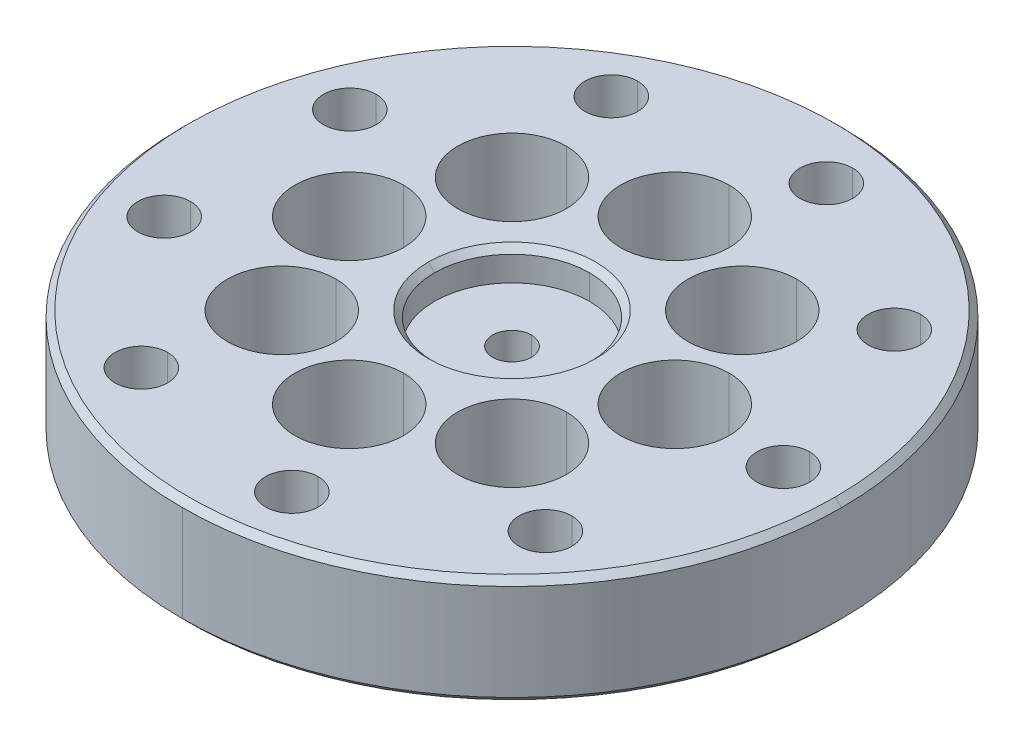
ISO-10303-21;
HEADER;
FILE_DESCRIPTION(('STEP AP214'),'2;1');
FILE_NAME('part.step','',(''),(''),'','','');
FILE_SCHEMA(('AUTOMOTIVE_DESIGN { 1 0 10303 214 1 1 1 1 }'));
ENDSEC;
DATA;
#1=APPLICATION_CONTEXT('core data for automotive mechanical design processes');
#2=APPLICATION_PROTOCOL_DEFINITION('international standard','automotive_design',2000,#1);
#3=PRODUCT_CONTEXT('',#1,'mechanical');
#4=PRODUCT('Part','Part','',(#3));
#5=PRODUCT_RELATED_PRODUCT_CATEGORY('part','',(#4));
#6=PRODUCT_DEFINITION_FORMATION('','',#4);
#7=PRODUCT_DEFINITION_CONTEXT('part definition',#1,'design');
#8=PRODUCT_DEFINITION('design','',#6,#7);
#9=PRODUCT_DEFINITION_SHAPE('','',#8);
#10=(LENGTH_UNIT() NAMED_UNIT(*) SI_UNIT(.MILLI.,.METRE.));
#11=(NAMED_UNIT(*) PLANE_ANGLE_UNIT() SI_UNIT($,.RADIAN.));
#12=(NAMED_UNIT(*) SI_UNIT($,.STERADIAN.) SOLID_ANGLE_UNIT());
#13=UNCERTAINTY_MEASURE_WITH_UNIT(LENGTH_MEASURE(1.E-05),#10,'distance_accuracy_value','');
#14=(GEOMETRIC_REPRESENTATION_CONTEXT(3) GLOBAL_UNCERTAINTY_ASSIGNED_CONTEXT((#13)) GLOBAL_UNIT_ASSIGNED_CONTEXT((#10,
#11,#12)) REPRESENTATION_CONTEXT('',''));
#15=CARTESIAN_POINT('',(0.,0.,0.));
#16=DIRECTION('',(0.,0.,1.));
#17=DIRECTION('',(1.,0.,0.));
#18=AXIS2_PLACEMENT_3D('',#15,#16,#17);
#19=CARTESIAN_POINT('',(-32.8892417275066,14.,-11.970705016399));
#20=DIRECTION('',(0.,1.,0.));
#21=DIRECTION('',(0.,0.,-1.));
#22=AXIS2_PLACEMENT_3D('',#19,#20,#21);
#23=CYLINDRICAL_SURFACE('',#22,3.4);
#24=CARTESIAN_POINT('',(-32.8892417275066,0.,-11.970705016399));
#25=DIRECTION('',(0.,-1.,0.));
#26=DIRECTION('',(0.,0.,1.));
#27=AXIS2_PLACEMENT_3D('',#24,#25,#26);
#28=CIRCLE('',#27,3.4);
#29=CARTESIAN_POINT('',(-32.8892417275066,0.,-8.570705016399));
#30=VERTEX_POINT('',#29);
#31=CARTESIAN_POINT('',(-32.8892417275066,0.,-15.370705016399));
#32=VERTEX_POINT('',#31);
#33=EDGE_CURVE('E11',#30,#32,#28,.T.);
#34=ORIENTED_EDGE('',*,*,#33,.T.);
#35=DIRECTION('',(0.,1.,0.));
#36=VECTOR('',#35,1.);
#37=CARTESIAN_POINT('',(-32.8892417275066,14.,-15.370705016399));
#38=LINE('',#37,#36);
#39=CARTESIAN_POINT('',(-32.8892417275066,14.,-15.370705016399));
#40=VERTEX_POINT('',#39);
#41=EDGE_CURVE('E28',#32,#40,#38,.T.);
#42=ORIENTED_EDGE('',*,*,#41,.T.);
#43=CARTESIAN_POINT('',(-32.8892417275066,14.,-11.970705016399));
#44=DIRECTION('',(0.,-1.,0.));
#45=DIRECTION('',(0.,0.,1.));
#46=AXIS2_PLACEMENT_3D('',#43,#44,#45);
#47=CIRCLE('',#46,3.4);
#48=CARTESIAN_POINT('',(-32.8892417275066,14.,-8.570705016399));
#49=VERTEX_POINT('',#48);
#50=EDGE_CURVE('E661',#49,#40,#47,.T.);
#51=ORIENTED_EDGE('',*,*,#50,.F.);
#52=DIRECTION('',(0.,1.,0.));
#53=VECTOR('',#52,1.);
#54=CARTESIAN_POINT('',(-32.8892417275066,14.,-8.570705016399));
#55=LINE('',#54,#53);
#56=EDGE_CURVE('E750',#30,#49,#55,.T.);
#57=ORIENTED_EDGE('',*,*,#56,.F.);
#58=EDGE_LOOP('',(#34,#42,#51,#57));
#59=FACE_BOUND('',#58,.T.);
#60=ADVANCED_FACE('F17',(#59),#23,.F.);
#61=CARTESIAN_POINT('',(-32.889241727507,14.,11.9707050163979));
#62=DIRECTION('',(0.,1.,0.));
#63=DIRECTION('',(0.,0.,-1.));
#64=AXIS2_PLACEMENT_3D('',#61,#62,#63);
#65=CYLINDRICAL_SURFACE('',#64,3.4);
#66=CARTESIAN_POINT('',(-32.889241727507,0.,11.9707050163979));
#67=DIRECTION('',(0.,-1.,0.));
#68=DIRECTION('',(0.,0.,1.));
#69=AXIS2_PLACEMENT_3D('',#66,#67,#68);
#70=CIRCLE('',#69,3.4);
#71=CARTESIAN_POINT('',(-32.889241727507,0.,15.3707050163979));
#72=VERTEX_POINT('',#71);
#73=CARTESIAN_POINT('',(-32.889241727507,0.,8.5707050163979));
#74=VERTEX_POINT('',#73);
#75=EDGE_CURVE('E1148',#72,#74,#70,.T.);
#76=ORIENTED_EDGE('',*,*,#75,.T.);
#77=DIRECTION('',(0.,1.,0.));
#78=VECTOR('',#77,1.);
#79=CARTESIAN_POINT('',(-32.889241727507,14.,8.5707050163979));
#80=LINE('',#79,#78);
#81=CARTESIAN_POINT('',(-32.889241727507,14.,8.5707050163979));
#82=VERTEX_POINT('',#81);
#83=EDGE_CURVE('E1139',#74,#82,#80,.T.);
#84=ORIENTED_EDGE('',*,*,#83,.T.);
#85=CARTESIAN_POINT('',(-32.889241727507,14.,11.9707050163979));
#86=DIRECTION('',(0.,-1.,0.));
#87=DIRECTION('',(0.,0.,1.));
#88=AXIS2_PLACEMENT_3D('',#85,#86,#87);
#89=CIRCLE('',#88,3.4);
#90=CARTESIAN_POINT('',(-32.889241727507,14.,15.3707050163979));
#91=VERTEX_POINT('',#90);
#92=EDGE_CURVE('E656',#91,#82,#89,.T.);
#93=ORIENTED_EDGE('',*,*,#92,.F.);
#94=DIRECTION('',(0.,1.,0.));
#95=VECTOR('',#94,1.);
#96=CARTESIAN_POINT('',(-32.889241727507,14.,15.3707050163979));
#97=LINE('',#96,#95);
#98=EDGE_CURVE('E745',#72,#91,#97,.T.);
#99=ORIENTED_EDGE('',*,*,#98,.F.);
#100=EDGE_LOOP('',(#76,#84,#93,#99));
#101=FACE_BOUND('',#100,.T.);
#102=ADVANCED_FACE('F1258',(#101),#65,.F.);
#103=CARTESIAN_POINT('',(-17.5000000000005,14.,30.3108891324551));
#104=DIRECTION('',(0.,1.,0.));
#105=DIRECTION('',(0.,0.,-1.));
#106=AXIS2_PLACEMENT_3D('',#103,#104,#105);
#107=CYLINDRICAL_SURFACE('',#106,3.4);
#108=CARTESIAN_POINT('',(-17.5000000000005,0.,30.3108891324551));
#109=DIRECTION('',(0.,-1.,0.));
#110=DIRECTION('',(0.,0.,1.));
#111=AXIS2_PLACEMENT_3D('',#108,#109,#110);
#112=CIRCLE('',#111,3.4);
#113=CARTESIAN_POINT('',(-17.5000000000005,0.,33.7108891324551));
#114=VERTEX_POINT('',#113);
#115=CARTESIAN_POINT('',(-17.5000000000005,0.,26.9108891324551));
#116=VERTEX_POINT('',#115);
#117=EDGE_CURVE('E1135',#114,#116,#112,.T.);
#118=ORIENTED_EDGE('',*,*,#117,.T.);
#119=DIRECTION('',(0.,1.,0.));
#120=VECTOR('',#119,1.);
#121=CARTESIAN_POINT('',(-17.5000000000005,14.,26.9108891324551));
#122=LINE('',#121,#120);
#123=CARTESIAN_POINT('',(-17.5000000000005,14.,26.9108891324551));
#124=VERTEX_POINT('',#123);
#125=EDGE_CURVE('E1127',#116,#124,#122,.T.);
#126=ORIENTED_EDGE('',*,*,#125,.T.);
#127=CARTESIAN_POINT('',(-17.5000000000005,14.,30.3108891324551));
#128=DIRECTION('',(0.,-1.,0.));
#129=DIRECTION('',(0.,0.,1.));
#130=AXIS2_PLACEMENT_3D('',#127,#128,#129);
#131=CIRCLE('',#130,3.4);
#132=CARTESIAN_POINT('',(-17.5000000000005,14.,33.7108891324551));
#133=VERTEX_POINT('',#132);
#134=EDGE_CURVE('E651',#133,#124,#131,.T.);
#135=ORIENTED_EDGE('',*,*,#134,.F.);
#136=DIRECTION('',(0.,1.,0.));
#137=VECTOR('',#136,1.);
#138=CARTESIAN_POINT('',(-17.5000000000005,14.,33.7108891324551));
#139=LINE('',#138,#137);
#140=EDGE_CURVE('E740',#114,#133,#139,.T.);
#141=ORIENTED_EDGE('',*,*,#140,.F.);
#142=EDGE_LOOP('',(#118,#126,#135,#141));
#143=FACE_BOUND('',#142,.T.);
#144=ADVANCED_FACE('F1263',(#143),#107,.F.);
#145=CARTESIAN_POINT('',(6.07768621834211,14.,34.4682713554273));
#146=DIRECTION('',(0.,1.,0.));
#147=DIRECTION('',(0.,0.,-1.));
#148=AXIS2_PLACEMENT_3D('',#145,#146,#147);
#149=CYLINDRICAL_SURFACE('',#148,3.4);
#150=CARTESIAN_POINT('',(6.07768621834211,0.,34.4682713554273));
#151=DIRECTION('',(0.,-1.,0.));
#152=DIRECTION('',(0.,0.,1.));
#153=AXIS2_PLACEMENT_3D('',#150,#151,#152);
#154=CIRCLE('',#153,3.4);
#155=CARTESIAN_POINT('',(6.07768621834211,0.,37.8682713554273));
#156=VERTEX_POINT('',#155);
#157=CARTESIAN_POINT('',(6.07768621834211,0.,31.0682713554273));
#158=VERTEX_POINT('',#157);
#159=EDGE_CURVE('E1123',#156,#158,#154,.T.);
#160=ORIENTED_EDGE('',*,*,#159,.T.);
#161=DIRECTION('',(0.,1.,0.));
#162=VECTOR('',#161,1.);
#163=CARTESIAN_POINT('',(6.07768621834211,14.,31.0682713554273));
#164=LINE('',#163,#162);
#165=CARTESIAN_POINT('',(6.07768621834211,14.,31.0682713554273));
#166=VERTEX_POINT('',#165);
#167=EDGE_CURVE('E1114',#158,#166,#164,.T.);
#168=ORIENTED_EDGE('',*,*,#167,.T.);
#169=CARTESIAN_POINT('',(6.07768621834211,14.,34.4682713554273));
#170=DIRECTION('',(0.,-1.,0.));
#171=DIRECTION('',(0.,0.,1.));
#172=AXIS2_PLACEMENT_3D('',#169,#170,#171);
#173=CIRCLE('',#172,3.4);
#174=CARTESIAN_POINT('',(6.07768621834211,14.,37.8682713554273));
#175=VERTEX_POINT('',#174);
#176=EDGE_CURVE('E646',#175,#166,#173,.T.);
#177=ORIENTED_EDGE('',*,*,#176,.F.);
#178=DIRECTION('',(0.,1.,0.));
#179=VECTOR('',#178,1.);
#180=CARTESIAN_POINT('',(6.07768621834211,14.,37.8682713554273));
#181=LINE('',#180,#179);
#182=EDGE_CURVE('E735',#156,#175,#181,.T.);
#183=ORIENTED_EDGE('',*,*,#182,.F.);
#184=EDGE_LOOP('',(#160,#168,#177,#183));
#185=FACE_BOUND('',#184,.T.);
#186=ADVANCED_FACE('F1269',(#185),#149,.F.);
#187=CARTESIAN_POINT('',(26.811555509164,14.,22.4975663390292));
#188=DIRECTION('',(0.,1.,0.));
#189=DIRECTION('',(0.,0.,-1.));
#190=AXIS2_PLACEMENT_3D('',#187,#188,#189);
#191=CYLINDRICAL_SURFACE('',#190,3.4);
#192=CARTESIAN_POINT('',(26.811555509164,0.,22.4975663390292));
#193=DIRECTION('',(0.,-1.,0.));
#194=DIRECTION('',(0.,0.,1.));
#195=AXIS2_PLACEMENT_3D('',#192,#193,#194);
#196=CIRCLE('',#195,3.4);
#197=CARTESIAN_POINT('',(26.811555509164,0.,25.8975663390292));
#198=VERTEX_POINT('',#197);
#199=CARTESIAN_POINT('',(26.811555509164,0.,19.0975663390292));
#200=VERTEX_POINT('',#199);
#201=EDGE_CURVE('E1110',#198,#200,#196,.T.);
#202=ORIENTED_EDGE('',*,*,#201,.T.);
#203=DIRECTION('',(0.,1.,0.));
#204=VECTOR('',#203,1.);
#205=CARTESIAN_POINT('',(26.811555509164,14.,19.0975663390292));
#206=LINE('',#205,#204);
#207=CARTESIAN_POINT('',(26.811555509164,14.,19.0975663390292));
#208=VERTEX_POINT('',#207);
#209=EDGE_CURVE('E1101',#200,#208,#206,.T.);
#210=ORIENTED_EDGE('',*,*,#209,.T.);
#211=CARTESIAN_POINT('',(26.811555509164,14.,22.4975663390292));
#212=DIRECTION('',(0.,-1.,0.));
#213=DIRECTION('',(0.,0.,1.));
#214=AXIS2_PLACEMENT_3D('',#211,#212,#213);
#215=CIRCLE('',#214,3.4);
#216=CARTESIAN_POINT('',(26.811555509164,14.,25.8975663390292));
#217=VERTEX_POINT('',#216);
#218=EDGE_CURVE('E641',#217,#208,#215,.T.);
#219=ORIENTED_EDGE('',*,*,#218,.F.);
#220=DIRECTION('',(0.,1.,0.));
#221=VECTOR('',#220,1.);
#222=CARTESIAN_POINT('',(26.811555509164,14.,25.8975663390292));
#223=LINE('',#222,#221);
#224=EDGE_CURVE('E730',#198,#217,#223,.T.);
#225=ORIENTED_EDGE('',*,*,#224,.F.);
#226=EDGE_LOOP('',(#202,#210,#219,#225));
#227=FACE_BOUND('',#226,.T.);
#228=ADVANCED_FACE('F1273',(#227),#191,.F.);
#229=CARTESIAN_POINT('',(35.,14.,3.6429192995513E-13));
#230=DIRECTION('',(0.,1.,0.));
#231=DIRECTION('',(0.,0.,-1.));
#232=AXIS2_PLACEMENT_3D('',#229,#230,#231);
#233=CYLINDRICAL_SURFACE('',#232,3.4);
#234=CARTESIAN_POINT('',(35.,0.,3.6429192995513E-13));
#235=DIRECTION('',(0.,-1.,0.));
#236=DIRECTION('',(0.,0.,1.));
#237=AXIS2_PLACEMENT_3D('',#234,#235,#236);
#238=CIRCLE('',#237,3.4);
#239=CARTESIAN_POINT('',(35.,0.,3.40000000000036));
#240=VERTEX_POINT('',#239);
#241=CARTESIAN_POINT('',(35.,0.,-3.39999999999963));
#242=VERTEX_POINT('',#241);
#243=EDGE_CURVE('E1097',#240,#242,#238,.T.);
#244=ORIENTED_EDGE('',*,*,#243,.T.);
#245=DIRECTION('',(0.,1.,0.));
#246=VECTOR('',#245,1.);
#247=CARTESIAN_POINT('',(35.,14.,-3.39999999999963));
#248=LINE('',#247,#246);
#249=CARTESIAN_POINT('',(35.,14.,-3.39999999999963));
#250=VERTEX_POINT('',#249);
#251=EDGE_CURVE('E1088',#242,#250,#248,.T.);
#252=ORIENTED_EDGE('',*,*,#251,.T.);
#253=CARTESIAN_POINT('',(35.,14.,3.6429192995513E-13));
#254=DIRECTION('',(0.,-1.,0.));
#255=DIRECTION('',(0.,0.,1.));
#256=AXIS2_PLACEMENT_3D('',#253,#254,#255);
#257=CIRCLE('',#256,3.4);
#258=CARTESIAN_POINT('',(35.,14.,3.40000000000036));
#259=VERTEX_POINT('',#258);
#260=EDGE_CURVE('E636',#259,#250,#257,.T.);
#261=ORIENTED_EDGE('',*,*,#260,.F.);
#262=DIRECTION('',(0.,1.,0.));
#263=VECTOR('',#262,1.);
#264=CARTESIAN_POINT('',(35.,14.,3.40000000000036));
#265=LINE('',#264,#263);
#266=EDGE_CURVE('E725',#240,#259,#265,.T.);
#267=ORIENTED_EDGE('',*,*,#266,.F.);
#268=EDGE_LOOP('',(#244,#252,#261,#267));
#269=FACE_BOUND('',#268,.T.);
#270=ADVANCED_FACE('F1277',(#269),#233,.F.);
#271=CARTESIAN_POINT('',(26.8115555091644,14.,-22.4975663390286));
#272=DIRECTION('',(0.,1.,0.));
#273=DIRECTION('',(0.,0.,-1.));
#274=AXIS2_PLACEMENT_3D('',#271,#272,#273);
#275=CYLINDRICAL_SURFACE('',#274,3.4);
#276=CARTESIAN_POINT('',(26.8115555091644,0.,-22.4975663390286));
#277=DIRECTION('',(0.,-1.,0.));
#278=DIRECTION('',(0.,0.,1.));
#279=AXIS2_PLACEMENT_3D('',#276,#277,#278);
#280=CIRCLE('',#279,3.4);
#281=CARTESIAN_POINT('',(26.8115555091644,0.,-19.0975663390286));
#282=VERTEX_POINT('',#281);
#283=CARTESIAN_POINT('',(26.8115555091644,0.,-25.8975663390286));
#284=VERTEX_POINT('',#283);
#285=EDGE_CURVE('E1084',#282,#284,#280,.T.);
#286=ORIENTED_EDGE('',*,*,#285,.T.);
#287=DIRECTION('',(0.,1.,0.));
#288=VECTOR('',#287,1.);
#289=CARTESIAN_POINT('',(26.8115555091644,14.,-25.8975663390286));
#290=LINE('',#289,#288);
#291=CARTESIAN_POINT('',(26.8115555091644,14.,-25.8975663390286));
#292=VERTEX_POINT('',#291);
#293=EDGE_CURVE('E1075',#284,#292,#290,.T.);
#294=ORIENTED_EDGE('',*,*,#293,.T.);
#295=CARTESIAN_POINT('',(26.8115555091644,14.,-22.4975663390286));
#296=DIRECTION('',(0.,-1.,0.));
#297=DIRECTION('',(0.,0.,1.));
#298=AXIS2_PLACEMENT_3D('',#295,#296,#297);
#299=CIRCLE('',#298,3.4);
#300=CARTESIAN_POINT('',(26.8115555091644,14.,-19.0975663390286));
#301=VERTEX_POINT('',#300);
#302=EDGE_CURVE('E631',#301,#292,#299,.T.);
#303=ORIENTED_EDGE('',*,*,#302,.F.);
#304=DIRECTION('',(0.,1.,0.));
#305=VECTOR('',#304,1.);
#306=CARTESIAN_POINT('',(26.8115555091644,14.,-19.0975663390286));
#307=LINE('',#306,#305);
#308=EDGE_CURVE('E720',#282,#301,#307,.T.);
#309=ORIENTED_EDGE('',*,*,#308,.F.);
#310=EDGE_LOOP('',(#286,#294,#303,#309));
#311=FACE_BOUND('',#310,.T.);
#312=ADVANCED_FACE('F1281',(#311),#275,.F.);
#313=CARTESIAN_POINT('',(6.07768621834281,14.,-34.4682713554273));
#314=DIRECTION('',(0.,1.,0.));
#315=DIRECTION('',(0.,0.,-1.));
#316=AXIS2_PLACEMENT_3D('',#313,#314,#315);
#317=CYLINDRICAL_SURFACE('',#316,3.4);
#318=CARTESIAN_POINT('',(6.07768621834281,0.,-34.4682713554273));
#319=DIRECTION('',(0.,-1.,0.));
#320=DIRECTION('',(0.,0.,1.));
#321=AXIS2_PLACEMENT_3D('',#318,#319,#320);
#322=CIRCLE('',#321,3.4);
#323=CARTESIAN_POINT('',(6.07768621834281,0.,-31.0682713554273));
#324=VERTEX_POINT('',#323);
#325=CARTESIAN_POINT('',(6.07768621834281,0.,-37.8682713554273));
#326=VERTEX_POINT('',#325);
#327=EDGE_CURVE('E1071',#324,#326,#322,.T.);
#328=ORIENTED_EDGE('',*,*,#327,.T.);
#329=DIRECTION('',(0.,1.,0.));
#330=VECTOR('',#329,1.);
#331=CARTESIAN_POINT('',(6.07768621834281,14.,-37.8682713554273));
#332=LINE('',#331,#330);
#333=CARTESIAN_POINT('',(6.07768621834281,14.,-37.8682713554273));
#334=VERTEX_POINT('',#333);
#335=EDGE_CURVE('E1062',#326,#334,#332,.T.);
#336=ORIENTED_EDGE('',*,*,#335,.T.);
#337=CARTESIAN_POINT('',(6.07768621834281,14.,-34.4682713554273));
#338=DIRECTION('',(0.,-1.,0.));
#339=DIRECTION('',(0.,0.,1.));
#340=AXIS2_PLACEMENT_3D('',#337,#338,#339);
#341=CIRCLE('',#340,3.4);
#342=CARTESIAN_POINT('',(6.07768621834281,14.,-31.0682713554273));
#343=VERTEX_POINT('',#342);
#344=EDGE_CURVE('E626',#343,#334,#341,.T.);
#345=ORIENTED_EDGE('',*,*,#344,.F.);
#346=DIRECTION('',(0.,1.,0.));
#347=VECTOR('',#346,1.);
#348=CARTESIAN_POINT('',(6.07768621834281,14.,-31.0682713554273));
#349=LINE('',#348,#347);
#350=EDGE_CURVE('E715',#324,#343,#349,.T.);
#351=ORIENTED_EDGE('',*,*,#350,.F.);
#352=EDGE_LOOP('',(#328,#336,#345,#351));
#353=FACE_BOUND('',#352,.T.);
#354=ADVANCED_FACE('F1285',(#353),#317,.F.);
#355=CARTESIAN_POINT('',(-17.5,14.,-30.3108891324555));
#356=DIRECTION('',(0.,1.,0.));
#357=DIRECTION('',(0.,0.,-1.));
#358=AXIS2_PLACEMENT_3D('',#355,#356,#357);
#359=CYLINDRICAL_SURFACE('',#358,3.4);
#360=CARTESIAN_POINT('',(-17.5,0.,-30.3108891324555));
#361=DIRECTION('',(0.,-1.,0.));
#362=DIRECTION('',(0.,0.,1.));
#363=AXIS2_PLACEMENT_3D('',#360,#361,#362);
#364=CIRCLE('',#363,3.4);
#365=CARTESIAN_POINT('',(-17.5,0.,-26.9108891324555));
#366=VERTEX_POINT('',#365);
#367=CARTESIAN_POINT('',(-17.5,0.,-33.7108891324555));
#368=VERTEX_POINT('',#367);
#369=EDGE_CURVE('E1058',#366,#368,#364,.T.);
#370=ORIENTED_EDGE('',*,*,#369,.T.);
#371=DIRECTION('',(0.,1.,0.));
#372=VECTOR('',#371,1.);
#373=CARTESIAN_POINT('',(-17.5,14.,-33.7108891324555));
#374=LINE('',#373,#372);
#375=CARTESIAN_POINT('',(-17.5,14.,-33.7108891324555));
#376=VERTEX_POINT('',#375);
#377=EDGE_CURVE('E1049',#368,#376,#374,.T.);
#378=ORIENTED_EDGE('',*,*,#377,.T.);
#379=CARTESIAN_POINT('',(-17.5,14.,-30.3108891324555));
#380=DIRECTION('',(0.,-1.,0.));
#381=DIRECTION('',(0.,0.,1.));
#382=AXIS2_PLACEMENT_3D('',#379,#380,#381);
#383=CIRCLE('',#382,3.4);
#384=CARTESIAN_POINT('',(-17.5,14.,-26.9108891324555));
#385=VERTEX_POINT('',#384);
#386=EDGE_CURVE('E621',#385,#376,#383,.T.);
#387=ORIENTED_EDGE('',*,*,#386,.F.);
#388=DIRECTION('',(0.,1.,0.));
#389=VECTOR('',#388,1.);
#390=CARTESIAN_POINT('',(-17.5,14.,-26.9108891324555));
#391=LINE('',#390,#389);
#392=EDGE_CURVE('E710',#366,#385,#391,.T.);
#393=ORIENTED_EDGE('',*,*,#392,.F.);
#394=EDGE_LOOP('',(#370,#378,#387,#393));
#395=FACE_BOUND('',#394,.T.);
#396=ADVANCED_FACE('F1289',(#395),#359,.F.);
#397=CARTESIAN_POINT('',(-14.8492424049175,-4.,-14.8492424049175));
#398=DIRECTION('',(0.,1.,0.));
#399=DIRECTION('',(0.,0.,-1.));
#400=AXIS2_PLACEMENT_3D('',#397,#398,#399);
#401=CYLINDRICAL_SURFACE('',#400,4.25);
#402=CARTESIAN_POINT('',(-14.8492424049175,0.,-14.8492424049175));
#403=DIRECTION('',(0.,-1.,0.));
#404=DIRECTION('',(0.,0.,1.));
#405=AXIS2_PLACEMENT_3D('',#402,#403,#404);
#406=CIRCLE('',#405,4.25);
#407=CARTESIAN_POINT('',(-14.8492424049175,0.,-10.5992424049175));
#408=VERTEX_POINT('',#407);
#409=CARTESIAN_POINT('',(-14.8492424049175,0.,-19.0992424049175));
#410=VERTEX_POINT('',#409);
#411=EDGE_CURVE('E1045',#408,#410,#406,.T.);
#412=ORIENTED_EDGE('',*,*,#411,.T.);
#413=DIRECTION('',(0.,1.,0.));
#414=VECTOR('',#413,1.);
#415=CARTESIAN_POINT('',(-14.8492424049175,-4.,-19.0992424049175));
#416=LINE('',#415,#414);
#417=CARTESIAN_POINT('',(-14.8492424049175,4.,-19.0992424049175));
#418=VERTEX_POINT('',#417);
#419=EDGE_CURVE('E1037',#410,#418,#416,.T.);
#420=ORIENTED_EDGE('',*,*,#419,.T.);
#421=CARTESIAN_POINT('',(-14.8492424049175,4.,-14.8492424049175));
#422=DIRECTION('',(0.,-1.,0.));
#423=DIRECTION('',(0.,0.,1.));
#424=AXIS2_PLACEMENT_3D('',#421,#422,#423);
#425=CIRCLE('',#424,4.25);
#426=CARTESIAN_POINT('',(-14.8492424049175,4.,-10.5992424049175));
#427=VERTEX_POINT('',#426);
#428=EDGE_CURVE('E616',#427,#418,#425,.T.);
#429=ORIENTED_EDGE('',*,*,#428,.F.);
#430=DIRECTION('',(0.,1.,0.));
#431=VECTOR('',#430,1.);
#432=CARTESIAN_POINT('',(-14.8492424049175,-4.,-10.5992424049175));
#433=LINE('',#432,#431);
#434=EDGE_CURVE('E705',#408,#427,#433,.T.);
#435=ORIENTED_EDGE('',*,*,#434,.F.);
#436=EDGE_LOOP('',(#412,#420,#429,#435));
#437=FACE_BOUND('',#436,.T.);
#438=ADVANCED_FACE('F1293',(#437),#401,.F.);
#439=CARTESIAN_POINT('',(-21.,-4.,0.));
#440=DIRECTION('',(0.,1.,0.));
#441=DIRECTION('',(0.,0.,-1.));
#442=AXIS2_PLACEMENT_3D('',#439,#440,#441);
#443=CYLINDRICAL_SURFACE('',#442,4.25);
#444=CARTESIAN_POINT('',(-21.,0.,0.));
#445=DIRECTION('',(0.,-1.,0.));
#446=DIRECTION('',(0.,0.,1.));
#447=AXIS2_PLACEMENT_3D('',#444,#445,#446);
#448=CIRCLE('',#447,4.25);
#449=CARTESIAN_POINT('',(-21.,0.,4.25));
#450=VERTEX_POINT('',#449);
#451=CARTESIAN_POINT('',(-21.,0.,-4.25));
#452=VERTEX_POINT('',#451);
#453=EDGE_CURVE('E1033',#450,#452,#448,.T.);
#454=ORIENTED_EDGE('',*,*,#453,.T.);
#455=DIRECTION('',(0.,1.,0.));
#456=VECTOR('',#455,1.);
#457=CARTESIAN_POINT('',(-21.,-4.,-4.25));
#458=LINE('',#457,#456);
#459=CARTESIAN_POINT('',(-21.,4.,-4.25));
#460=VERTEX_POINT('',#459);
#461=EDGE_CURVE('E1024',#452,#460,#458,.T.);
#462=ORIENTED_EDGE('',*,*,#461,.T.);
#463=CARTESIAN_POINT('',(-21.,4.,0.));
#464=DIRECTION('',(0.,-1.,0.));
#465=DIRECTION('',(0.,0.,1.));
#466=AXIS2_PLACEMENT_3D('',#463,#464,#465);
#467=CIRCLE('',#466,4.25);
#468=CARTESIAN_POINT('',(-21.,4.,4.25));
#469=VERTEX_POINT('',#468);
#470=EDGE_CURVE('E612',#469,#460,#467,.T.);
#471=ORIENTED_EDGE('',*,*,#470,.F.);
#472=DIRECTION('',(0.,1.,0.));
#473=VECTOR('',#472,1.);
#474=CARTESIAN_POINT('',(-21.,-4.,4.25));
#475=LINE('',#474,#473);
#476=EDGE_CURVE('E700',#450,#469,#475,.T.);
#477=ORIENTED_EDGE('',*,*,#476,.F.);
#478=EDGE_LOOP('',(#454,#462,#471,#477));
#479=FACE_BOUND('',#478,.T.);
#480=ADVANCED_FACE('F1297',(#479),#443,.F.);
#481=CARTESIAN_POINT('',(-14.8492424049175,-4.,14.8492424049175));
#482=DIRECTION('',(0.,1.,0.));
#483=DIRECTION('',(0.,0.,-1.));
#484=AXIS2_PLACEMENT_3D('',#481,#482,#483);
#485=CYLINDRICAL_SURFACE('',#484,4.25);
#486=CARTESIAN_POINT('',(-14.8492424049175,0.,14.8492424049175));
#487=DIRECTION('',(0.,-1.,0.));
#488=DIRECTION('',(0.,0.,1.));
#489=AXIS2_PLACEMENT_3D('',#486,#487,#488);
#490=CIRCLE('',#489,4.25);
#491=CARTESIAN_POINT('',(-14.8492424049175,0.,19.0992424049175));
#492=VERTEX_POINT('',#491);
#493=CARTESIAN_POINT('',(-14.8492424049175,0.,10.5992424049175));
#494=VERTEX_POINT('',#493);
#495=EDGE_CURVE('E1020',#492,#494,#490,.T.);
#496=ORIENTED_EDGE('',*,*,#495,.T.);
#497=DIRECTION('',(0.,1.,0.));
#498=VECTOR('',#497,1.);
#499=CARTESIAN_POINT('',(-14.8492424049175,-4.,10.5992424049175));
#500=LINE('',#499,#498);
#501=CARTESIAN_POINT('',(-14.8492424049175,4.,10.5992424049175));
#502=VERTEX_POINT('',#501);
#503=EDGE_CURVE('E1011',#494,#502,#500,.T.);
#504=ORIENTED_EDGE('',*,*,#503,.T.);
#505=CARTESIAN_POINT('',(-14.8492424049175,4.,14.8492424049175));
#506=DIRECTION('',(0.,-1.,0.));
#507=DIRECTION('',(0.,0.,1.));
#508=AXIS2_PLACEMENT_3D('',#505,#506,#507);
#509=CIRCLE('',#508,4.25);
#510=CARTESIAN_POINT('',(-14.8492424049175,4.,19.0992424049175));
#511=VERTEX_POINT('',#510);
#512=EDGE_CURVE('E608',#511,#502,#509,.T.);
#513=ORIENTED_EDGE('',*,*,#512,.F.);
#514=DIRECTION('',(0.,1.,0.));
#515=VECTOR('',#514,1.);
#516=CARTESIAN_POINT('',(-14.8492424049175,-4.,19.0992424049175));
#517=LINE('',#516,#515);
#518=EDGE_CURVE('E695',#492,#511,#517,.T.);
#519=ORIENTED_EDGE('',*,*,#518,.F.);
#520=EDGE_LOOP('',(#496,#504,#513,#519));
#521=FACE_BOUND('',#520,.T.);
#522=ADVANCED_FACE('F1301',(#521),#485,.F.);
#523=CARTESIAN_POINT('',(0.,-4.,21.));
#524=DIRECTION('',(0.,1.,0.));
#525=DIRECTION('',(0.,0.,-1.));
#526=AXIS2_PLACEMENT_3D('',#523,#524,#525);
#527=CYLINDRICAL_SURFACE('',#526,4.25);
#528=CARTESIAN_POINT('',(0.,0.,21.));
#529=DIRECTION('',(0.,-1.,0.));
#530=DIRECTION('',(0.,0.,1.));
#531=AXIS2_PLACEMENT_3D('',#528,#529,#530);
#532=CIRCLE('',#531,4.25);
#533=CARTESIAN_POINT('',(0.,0.,25.25));
#534=VERTEX_POINT('',#533);
#535=CARTESIAN_POINT('',(0.,0.,16.75));
#536=VERTEX_POINT('',#535);
#537=EDGE_CURVE('E1007',#534,#536,#532,.T.);
#538=ORIENTED_EDGE('',*,*,#537,.T.);
#539=DIRECTION('',(0.,1.,0.));
#540=VECTOR('',#539,1.);
#541=CARTESIAN_POINT('',(0.,-4.,16.75));
#542=LINE('',#541,#540);
#543=CARTESIAN_POINT('',(0.,4.,16.75));
#544=VERTEX_POINT('',#543);
#545=EDGE_CURVE('E998',#536,#544,#542,.T.);
#546=ORIENTED_EDGE('',*,*,#545,.T.);
#547=CARTESIAN_POINT('',(0.,4.,21.));
#548=DIRECTION('',(0.,-1.,0.));
#549=DIRECTION('',(0.,0.,1.));
#550=AXIS2_PLACEMENT_3D('',#547,#548,#549);
#551=CIRCLE('',#550,4.25);
#552=CARTESIAN_POINT('',(0.,4.,25.25));
#553=VERTEX_POINT('',#552);
#554=EDGE_CURVE('E604',#553,#544,#551,.T.);
#555=ORIENTED_EDGE('',*,*,#554,.F.);
#556=DIRECTION('',(0.,1.,0.));
#557=VECTOR('',#556,1.);
#558=CARTESIAN_POINT('',(0.,-4.,25.25));
#559=LINE('',#558,#557);
#560=EDGE_CURVE('E690',#534,#553,#559,.T.);
#561=ORIENTED_EDGE('',*,*,#560,.F.);
#562=EDGE_LOOP('',(#538,#546,#555,#561));
#563=FACE_BOUND('',#562,.T.);
#564=ADVANCED_FACE('F1305',(#563),#527,.F.);
#565=CARTESIAN_POINT('',(14.8492424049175,-4.,14.8492424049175));
#566=DIRECTION('',(0.,1.,0.));
#567=DIRECTION('',(0.,0.,-1.));
#568=AXIS2_PLACEMENT_3D('',#565,#566,#567);
#569=CYLINDRICAL_SURFACE('',#568,4.25);
#570=CARTESIAN_POINT('',(14.8492424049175,0.,14.8492424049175));
#571=DIRECTION('',(0.,-1.,0.));
#572=DIRECTION('',(0.,0.,1.));
#573=AXIS2_PLACEMENT_3D('',#570,#571,#572);
#574=CIRCLE('',#573,4.25);
#575=CARTESIAN_POINT('',(14.8492424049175,0.,19.0992424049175));
#576=VERTEX_POINT('',#575);
#577=CARTESIAN_POINT('',(14.8492424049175,0.,10.5992424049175));
#578=VERTEX_POINT('',#577);
#579=EDGE_CURVE('E994',#576,#578,#574,.T.);
#580=ORIENTED_EDGE('',*,*,#579,.T.);
#581=DIRECTION('',(0.,1.,0.));
#582=VECTOR('',#581,1.);
#583=CARTESIAN_POINT('',(14.8492424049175,-4.,10.5992424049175));
#584=LINE('',#583,#582);
#585=CARTESIAN_POINT('',(14.8492424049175,4.,10.5992424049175));
#586=VERTEX_POINT('',#585);
#587=EDGE_CURVE('E985',#578,#586,#584,.T.);
#588=ORIENTED_EDGE('',*,*,#587,.T.);
#589=CARTESIAN_POINT('',(14.8492424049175,4.,14.8492424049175));
#590=DIRECTION('',(0.,-1.,0.));
#591=DIRECTION('',(0.,0.,1.));
#592=AXIS2_PLACEMENT_3D('',#589,#590,#591);
#593=CIRCLE('',#592,4.25);
#594=CARTESIAN_POINT('',(14.8492424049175,4.,19.0992424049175));
#595=VERTEX_POINT('',#594);
#596=EDGE_CURVE('E600',#595,#586,#593,.T.);
#597=ORIENTED_EDGE('',*,*,#596,.F.);
#598=DIRECTION('',(0.,1.,0.));
#599=VECTOR('',#598,1.);
#600=CARTESIAN_POINT('',(14.8492424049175,-4.,19.0992424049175));
#601=LINE('',#600,#599);
#602=EDGE_CURVE('E685',#576,#595,#601,.T.);
#603=ORIENTED_EDGE('',*,*,#602,.F.);
#604=EDGE_LOOP('',(#580,#588,#597,#603));
#605=FACE_BOUND('',#604,.T.);
#606=ADVANCED_FACE('F1309',(#605),#569,.F.);
#607=CARTESIAN_POINT('',(21.,-4.,0.));
#608=DIRECTION('',(0.,1.,0.));
#609=DIRECTION('',(0.,0.,-1.));
#610=AXIS2_PLACEMENT_3D('',#607,#608,#609);
#611=CYLINDRICAL_SURFACE('',#610,4.25);
#612=CARTESIAN_POINT('',(21.,0.,0.));
#613=DIRECTION('',(0.,-1.,0.));
#614=DIRECTION('',(0.,0.,1.));
#615=AXIS2_PLACEMENT_3D('',#612,#613,#614);
#616=CIRCLE('',#615,4.25);
#617=CARTESIAN_POINT('',(21.,0.,4.25));
#618=VERTEX_POINT('',#617);
#619=CARTESIAN_POINT('',(21.,0.,-4.25));
#620=VERTEX_POINT('',#619);
#621=EDGE_CURVE('E981',#618,#620,#616,.T.);
#622=ORIENTED_EDGE('',*,*,#621,.T.);
#623=DIRECTION('',(0.,1.,0.));
#624=VECTOR('',#623,1.);
#625=CARTESIAN_POINT('',(21.,-4.,-4.25));
#626=LINE('',#625,#624);
#627=CARTESIAN_POINT('',(21.,4.,-4.25));
#628=VERTEX_POINT('',#627);
#629=EDGE_CURVE('E972',#620,#628,#626,.T.);
#630=ORIENTED_EDGE('',*,*,#629,.T.);
#631=CARTESIAN_POINT('',(21.,4.,0.));
#632=DIRECTION('',(0.,-1.,0.));
#633=DIRECTION('',(0.,0.,1.));
#634=AXIS2_PLACEMENT_3D('',#631,#632,#633);
#635=CIRCLE('',#634,4.25);
#636=CARTESIAN_POINT('',(21.,4.,4.25));
#637=VERTEX_POINT('',#636);
#638=EDGE_CURVE('E596',#637,#628,#635,.T.);
#639=ORIENTED_EDGE('',*,*,#638,.F.);
#640=DIRECTION('',(0.,1.,0.));
#641=VECTOR('',#640,1.);
#642=CARTESIAN_POINT('',(21.,-4.,4.25));
#643=LINE('',#642,#641);
#644=EDGE_CURVE('E680',#618,#637,#643,.T.);
#645=ORIENTED_EDGE('',*,*,#644,.F.);
#646=EDGE_LOOP('',(#622,#630,#639,#645));
#647=FACE_BOUND('',#646,.T.);
#648=ADVANCED_FACE('F1313',(#647),#611,.F.);
#649=CARTESIAN_POINT('',(14.8492424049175,-4.,-14.8492424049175));
#650=DIRECTION('',(0.,1.,0.));
#651=DIRECTION('',(0.,0.,-1.));
#652=AXIS2_PLACEMENT_3D('',#649,#650,#651);
#653=CYLINDRICAL_SURFACE('',#652,4.25);
#654=CARTESIAN_POINT('',(14.8492424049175,0.,-14.8492424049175));
#655=DIRECTION('',(0.,-1.,0.));
#656=DIRECTION('',(0.,0.,1.));
#657=AXIS2_PLACEMENT_3D('',#654,#655,#656);
#658=CIRCLE('',#657,4.25);
#659=CARTESIAN_POINT('',(14.8492424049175,0.,-10.5992424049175));
#660=VERTEX_POINT('',#659);
#661=CARTESIAN_POINT('',(14.8492424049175,0.,-19.0992424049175));
#662=VERTEX_POINT('',#661);
#663=EDGE_CURVE('E968',#660,#662,#658,.T.);
#664=ORIENTED_EDGE('',*,*,#663,.T.);
#665=DIRECTION('',(0.,1.,0.));
#666=VECTOR('',#665,1.);
#667=CARTESIAN_POINT('',(14.8492424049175,-4.,-19.0992424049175));
#668=LINE('',#667,#666);
#669=CARTESIAN_POINT('',(14.8492424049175,4.,-19.0992424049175));
#670=VERTEX_POINT('',#669);
#671=EDGE_CURVE('E959',#662,#670,#668,.T.);
#672=ORIENTED_EDGE('',*,*,#671,.T.);
#673=CARTESIAN_POINT('',(14.8492424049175,4.,-14.8492424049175));
#674=DIRECTION('',(0.,-1.,0.));
#675=DIRECTION('',(0.,0.,1.));
#676=AXIS2_PLACEMENT_3D('',#673,#674,#675);
#677=CIRCLE('',#676,4.25);
#678=CARTESIAN_POINT('',(14.8492424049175,4.,-10.5992424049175));
#679=VERTEX_POINT('',#678);
#680=EDGE_CURVE('E592',#679,#670,#677,.T.);
#681=ORIENTED_EDGE('',*,*,#680,.F.);
#682=DIRECTION('',(0.,1.,0.));
#683=VECTOR('',#682,1.);
#684=CARTESIAN_POINT('',(14.8492424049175,-4.,-10.5992424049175));
#685=LINE('',#684,#683);
#686=EDGE_CURVE('E675',#660,#679,#685,.T.);
#687=ORIENTED_EDGE('',*,*,#686,.F.);
#688=EDGE_LOOP('',(#664,#672,#681,#687));
#689=FACE_BOUND('',#688,.T.);
#690=ADVANCED_FACE('F1317',(#689),#653,.F.);
#691=CARTESIAN_POINT('',(0.,-4.,-21.));
#692=DIRECTION('',(0.,1.,0.));
#693=DIRECTION('',(0.,0.,-1.));
#694=AXIS2_PLACEMENT_3D('',#691,#692,#693);
#695=CYLINDRICAL_SURFACE('',#694,4.25);
#696=CARTESIAN_POINT('',(0.,0.,-21.));
#697=DIRECTION('',(0.,-1.,0.));
#698=DIRECTION('',(0.,0.,1.));
#699=AXIS2_PLACEMENT_3D('',#696,#697,#698);
#700=CIRCLE('',#699,4.25);
#701=CARTESIAN_POINT('',(0.,0.,-16.75));
#702=VERTEX_POINT('',#701);
#703=CARTESIAN_POINT('',(0.,0.,-25.25));
#704=VERTEX_POINT('',#703);
#705=EDGE_CURVE('E955',#702,#704,#700,.T.);
#706=ORIENTED_EDGE('',*,*,#705,.T.);
#707=DIRECTION('',(0.,1.,0.));
#708=VECTOR('',#707,1.);
#709=CARTESIAN_POINT('',(0.,-4.,-25.25));
#710=LINE('',#709,#708);
#711=CARTESIAN_POINT('',(0.,4.,-25.25));
#712=VERTEX_POINT('',#711);
#713=EDGE_CURVE('E946',#704,#712,#710,.T.);
#714=ORIENTED_EDGE('',*,*,#713,.T.);
#715=CARTESIAN_POINT('',(0.,4.,-21.));
#716=DIRECTION('',(0.,-1.,0.));
#717=DIRECTION('',(0.,0.,1.));
#718=AXIS2_PLACEMENT_3D('',#715,#716,#717);
#719=CIRCLE('',#718,4.25);
#720=CARTESIAN_POINT('',(0.,4.,-16.75));
#721=VERTEX_POINT('',#720);
#722=EDGE_CURVE('E588',#721,#712,#719,.T.);
#723=ORIENTED_EDGE('',*,*,#722,.F.);
#724=DIRECTION('',(0.,1.,0.));
#725=VECTOR('',#724,1.);
#726=CARTESIAN_POINT('',(0.,-4.,-16.75));
#727=LINE('',#726,#725);
#728=EDGE_CURVE('E670',#702,#721,#727,.T.);
#729=ORIENTED_EDGE('',*,*,#728,.F.);
#730=EDGE_LOOP('',(#706,#714,#723,#729));
#731=FACE_BOUND('',#730,.T.);
#732=ADVANCED_FACE('F1321',(#731),#695,.F.);
#733=CARTESIAN_POINT('',(0.,0.799999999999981,0.));
#734=DIRECTION('',(0.,1.,0.));
#735=DIRECTION('',(1.,0.,0.));
#736=AXIS2_PLACEMENT_3D('',#733,#734,#735);
#737=CONICAL_SURFACE('',#736,42.5,0.785398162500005);
#738=CARTESIAN_POINT('',(0.,-7.17962907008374E-10,0.));
#739=DIRECTION('',(0.,1.,0.));
#740=DIRECTION('',(-1.,0.,0.));
#741=AXIS2_PLACEMENT_3D('',#738,#739,#740);
#742=CIRCLE('',#741,41.7000000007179);
#743=CARTESIAN_POINT('',(-41.7000000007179,-7.17962800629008E-10,0.));
#744=VERTEX_POINT('',#743);
#745=CARTESIAN_POINT('',(41.7000000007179,-7.1796301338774E-10,0.));
#746=VERTEX_POINT('',#745);
#747=EDGE_CURVE('E942',#744,#746,#742,.T.);
#748=ORIENTED_EDGE('',*,*,#747,.T.);
#749=DIRECTION('',(0.707106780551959,0.707106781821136,0.));
#750=VECTOR('',#749,1.);
#751=CARTESIAN_POINT('',(42.5,0.799999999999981,0.));
#752=LINE('',#751,#750);
#753=CARTESIAN_POINT('',(42.5,0.799999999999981,0.));
#754=VERTEX_POINT('',#753);
#755=EDGE_CURVE('E939',#754,#746,#752,.F.);
#756=ORIENTED_EDGE('',*,*,#755,.F.);
#757=CARTESIAN_POINT('',(0.,0.799999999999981,0.));
#758=DIRECTION('',(0.,-1.,0.));
#759=DIRECTION('',(-1.,0.,0.));
#760=AXIS2_PLACEMENT_3D('',#757,#758,#759);
#761=CIRCLE('',#760,42.5);
#762=CARTESIAN_POINT('',(0.,0.799999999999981,42.5));
#763=VERTEX_POINT('',#762);
#764=EDGE_CURVE('E935',#754,#763,#761,.T.);
#765=ORIENTED_EDGE('',*,*,#764,.T.);
#766=CARTESIAN_POINT('',(0.,0.799999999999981,0.));
#767=DIRECTION('',(0.,-1.,0.));
#768=DIRECTION('',(-1.,0.,0.));
#769=AXIS2_PLACEMENT_3D('',#766,#767,#768);
#770=CIRCLE('',#769,42.5);
#771=CARTESIAN_POINT('',(-42.5,0.799999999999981,0.));
#772=VERTEX_POINT('',#771);
#773=EDGE_CURVE('E929',#763,#772,#770,.T.);
#774=ORIENTED_EDGE('',*,*,#773,.T.);
#775=DIRECTION('',(-0.707106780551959,0.707106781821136,0.));
#776=VECTOR('',#775,1.);
#777=CARTESIAN_POINT('',(-42.5,0.799999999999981,0.));
#778=LINE('',#777,#776);
#779=EDGE_CURVE('E583',#772,#744,#778,.F.);
#780=ORIENTED_EDGE('',*,*,#779,.T.);
#781=EDGE_LOOP('',(#748,#756,#765,#774,#780));
#782=FACE_BOUND('',#781,.T.);
#783=ADVANCED_FACE('F1217',(#782),#737,.T.);
#784=CARTESIAN_POINT('',(0.,-4.,0.));
#785=DIRECTION('',(0.,1.,0.));
#786=DIRECTION('',(0.,0.,-1.));
#787=AXIS2_PLACEMENT_3D('',#784,#785,#786);
#788=CYLINDRICAL_SURFACE('',#787,10.);
#789=CARTESIAN_POINT('',(0.,-3.2,0.));
#790=DIRECTION('',(0.,1.,0.));
#791=DIRECTION('',(0.,0.,1.));
#792=AXIS2_PLACEMENT_3D('',#789,#790,#791);
#793=CIRCLE('',#792,10.);
#794=CARTESIAN_POINT('',(0.,-3.2,10.));
#795=VERTEX_POINT('',#794);
#796=CARTESIAN_POINT('',(0.,-3.2,-10.));
#797=VERTEX_POINT('',#796);
#798=EDGE_CURVE('E925',#795,#797,#793,.T.);
#799=ORIENTED_EDGE('',*,*,#798,.T.);
#800=DIRECTION('',(0.,1.,0.));
#801=VECTOR('',#800,1.);
#802=CARTESIAN_POINT('',(0.,-4.,-10.));
#803=LINE('',#802,#801);
#804=CARTESIAN_POINT('',(0.,0.,-10.));
#805=VERTEX_POINT('',#804);
#806=EDGE_CURVE('E921',#797,#805,#803,.T.);
#807=ORIENTED_EDGE('',*,*,#806,.T.);
#808=CARTESIAN_POINT('',(0.,0.,0.));
#809=DIRECTION('',(0.,-1.,0.));
#810=DIRECTION('',(0.,0.,1.));
#811=AXIS2_PLACEMENT_3D('',#808,#809,#810);
#812=CIRCLE('',#811,10.);
#813=CARTESIAN_POINT('',(0.,0.,10.));
#814=VERTEX_POINT('',#813);
#815=EDGE_CURVE('E915',#805,#814,#812,.T.);
#816=ORIENTED_EDGE('',*,*,#815,.T.);
#817=DIRECTION('',(0.,1.,0.));
#818=VECTOR('',#817,1.);
#819=CARTESIAN_POINT('',(0.,-4.,10.));
#820=LINE('',#819,#818);
#821=EDGE_CURVE('E578',#795,#814,#820,.T.);
#822=ORIENTED_EDGE('',*,*,#821,.F.);
#823=EDGE_LOOP('',(#799,#807,#816,#822));
#824=FACE_BOUND('',#823,.T.);
#825=ADVANCED_FACE('F1235',(#824),#788,.T.);
#826=CARTESIAN_POINT('',(0.,14.,0.));
#827=DIRECTION('',(0.,-1.,0.));
#828=DIRECTION('',(0.,0.,1.));
#829=AXIS2_PLACEMENT_3D('',#826,#827,#828);
#830=CYLINDRICAL_SURFACE('',#829,42.5);
#831=CARTESIAN_POINT('',(0.,13.2,0.));
#832=DIRECTION('',(0.,-1.,0.));
#833=DIRECTION('',(0.,0.,-1.));
#834=AXIS2_PLACEMENT_3D('',#831,#832,#833);
#835=CIRCLE('',#834,42.5);
#836=CARTESIAN_POINT('',(42.5,13.2,0.));
#837=VERTEX_POINT('',#836);
#838=CARTESIAN_POINT('',(0.,13.2,42.5));
#839=VERTEX_POINT('',#838);
#840=EDGE_CURVE('E911',#837,#839,#835,.T.);
#841=ORIENTED_EDGE('',*,*,#840,.T.);
#842=DIRECTION('',(0.,-1.,0.));
#843=VECTOR('',#842,1.);
#844=CARTESIAN_POINT('',(0.,14.,42.5));
#845=LINE('',#844,#843);
#846=EDGE_CURVE('E903',#763,#839,#845,.F.);
#847=ORIENTED_EDGE('',*,*,#846,.F.);
#848=ORIENTED_EDGE('',*,*,#764,.F.);
#849=CARTESIAN_POINT('',(0.,0.799999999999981,0.));
#850=DIRECTION('',(0.,-1.,0.));
#851=DIRECTION('',(-1.,0.,0.));
#852=AXIS2_PLACEMENT_3D('',#849,#850,#851);
#853=CIRCLE('',#852,42.5);
#854=CARTESIAN_POINT('',(0.,0.799999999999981,-42.5));
#855=VERTEX_POINT('',#854);
#856=EDGE_CURVE('E577',#855,#754,#853,.T.);
#857=ORIENTED_EDGE('',*,*,#856,.F.);
#858=DIRECTION('',(0.,-1.,0.));
#859=VECTOR('',#858,1.);
#860=CARTESIAN_POINT('',(0.,14.,-42.5));
#861=LINE('',#860,#859);
#862=CARTESIAN_POINT('',(0.,13.2,-42.5));
#863=VERTEX_POINT('',#862);
#864=EDGE_CURVE('E469',#855,#863,#861,.F.);
#865=ORIENTED_EDGE('',*,*,#864,.T.);
#866=CARTESIAN_POINT('',(0.,13.2,0.));
#867=DIRECTION('',(0.,-1.,0.));
#868=DIRECTION('',(0.,0.,-1.));
#869=AXIS2_PLACEMENT_3D('',#866,#867,#868);
#870=CIRCLE('',#869,42.5);
#871=EDGE_CURVE('E900',#863,#837,#870,.T.);
#872=ORIENTED_EDGE('',*,*,#871,.T.);
#873=EDGE_LOOP('',(#841,#847,#848,#857,#865,#872));
#874=FACE_BOUND('',#873,.T.);
#875=ADVANCED_FACE('F1210',(#874),#830,.T.);
#876=CARTESIAN_POINT('',(0.,-3.2,0.));
#877=DIRECTION('',(0.,1.,0.));
#878=DIRECTION('',(0.,0.,-1.));
#879=AXIS2_PLACEMENT_3D('',#876,#877,#878);
#880=CONICAL_SURFACE('',#879,10.,0.785398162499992);
#881=CARTESIAN_POINT('',(0.,-4.00000000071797,0.));
#882=DIRECTION('',(0.,1.,0.));
#883=DIRECTION('',(0.,0.,1.));
#884=AXIS2_PLACEMENT_3D('',#881,#882,#883);
#885=CIRCLE('',#884,9.20000000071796);
#886=CARTESIAN_POINT('',(0.,-4.00000000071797,9.20000000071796));
#887=VERTEX_POINT('',#886);
#888=CARTESIAN_POINT('',(0.,-4.00000000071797,-9.20000000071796));
#889=VERTEX_POINT('',#888);
#890=EDGE_CURVE('E896',#887,#889,#885,.T.);
#891=ORIENTED_EDGE('',*,*,#890,.T.);
#892=DIRECTION('',(0.,0.707106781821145,-0.70710678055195));
#893=VECTOR('',#892,1.);
#894=CARTESIAN_POINT('',(0.,-3.2,-10.));
#895=LINE('',#894,#893);
#896=EDGE_CURVE('E888',#889,#797,#895,.T.);
#897=ORIENTED_EDGE('',*,*,#896,.T.);
#898=ORIENTED_EDGE('',*,*,#798,.F.);
#899=DIRECTION('',(0.,0.707106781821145,0.70710678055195));
#900=VECTOR('',#899,1.);
#901=CARTESIAN_POINT('',(0.,-3.2,10.));
#902=LINE('',#901,#900);
#903=EDGE_CURVE('E470',#887,#795,#902,.T.);
#904=ORIENTED_EDGE('',*,*,#903,.F.);
#905=EDGE_LOOP('',(#891,#897,#898,#904));
#906=FACE_BOUND('',#905,.T.);
#907=ADVANCED_FACE('F1241',(#906),#880,.T.);
#908=CARTESIAN_POINT('',(-14.8492424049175,4.,-14.8492424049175));
#909=DIRECTION('',(0.,1.,0.));
#910=DIRECTION('',(0.,0.,-1.));
#911=AXIS2_PLACEMENT_3D('',#908,#909,#910);
#912=CYLINDRICAL_SURFACE('',#911,7.);
#913=CARTESIAN_POINT('',(-14.8492424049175,4.,-14.8492424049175));
#914=DIRECTION('',(0.,1.,0.));
#915=DIRECTION('',(0.,0.,1.));
#916=AXIS2_PLACEMENT_3D('',#913,#914,#915);
#917=CIRCLE('',#916,7.);
#918=CARTESIAN_POINT('',(-14.8492424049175,4.,-21.8492424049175));
#919=VERTEX_POINT('',#918);
#920=CARTESIAN_POINT('',(-14.8492424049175,4.,-7.8492424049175));
#921=VERTEX_POINT('',#920);
#922=EDGE_CURVE('E523',#919,#921,#917,.T.);
#923=ORIENTED_EDGE('',*,*,#922,.F.);
#924=DIRECTION('',(0.,1.,0.));
#925=VECTOR('',#924,1.);
#926=CARTESIAN_POINT('',(-14.8492424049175,4.,-21.8492424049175));
#927=LINE('',#926,#925);
#928=CARTESIAN_POINT('',(-14.8492424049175,14.,-21.8492424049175));
#929=VERTEX_POINT('',#928);
#930=EDGE_CURVE('E877',#919,#929,#927,.T.);
#931=ORIENTED_EDGE('',*,*,#930,.T.);
#932=CARTESIAN_POINT('',(-14.8492424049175,14.,-14.8492424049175));
#933=DIRECTION('',(0.,-1.,0.));
#934=DIRECTION('',(0.,0.,1.));
#935=AXIS2_PLACEMENT_3D('',#932,#933,#934);
#936=CIRCLE('',#935,7.);
#937=CARTESIAN_POINT('',(-14.8492424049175,14.,-7.8492424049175));
#938=VERTEX_POINT('',#937);
#939=EDGE_CURVE('E572',#938,#929,#936,.T.);
#940=ORIENTED_EDGE('',*,*,#939,.F.);
#941=DIRECTION('',(0.,1.,0.));
#942=VECTOR('',#941,1.);
#943=CARTESIAN_POINT('',(-14.8492424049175,4.,-7.8492424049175));
#944=LINE('',#943,#942);
#945=EDGE_CURVE('E871',#921,#938,#944,.T.);
#946=ORIENTED_EDGE('',*,*,#945,.F.);
#947=EDGE_LOOP('',(#923,#931,#940,#946));
#948=FACE_BOUND('',#947,.T.);
#949=ADVANCED_FACE('F1334',(#948),#912,.F.);
#950=CARTESIAN_POINT('',(-21.,4.,0.));
#951=DIRECTION('',(0.,1.,0.));
#952=DIRECTION('',(0.,0.,-1.));
#953=AXIS2_PLACEMENT_3D('',#950,#951,#952);
#954=CYLINDRICAL_SURFACE('',#953,7.);
#955=CARTESIAN_POINT('',(-21.,4.,0.));
#956=DIRECTION('',(0.,1.,0.));
#957=DIRECTION('',(0.,0.,1.));
#958=AXIS2_PLACEMENT_3D('',#955,#956,#957);
#959=CIRCLE('',#958,7.);
#960=CARTESIAN_POINT('',(-21.,4.,-7.));
#961=VERTEX_POINT('',#960);
#962=CARTESIAN_POINT('',(-21.,4.,7.));
#963=VERTEX_POINT('',#962);
#964=EDGE_CURVE('E517',#961,#963,#959,.T.);
#965=ORIENTED_EDGE('',*,*,#964,.F.);
#966=DIRECTION('',(0.,1.,0.));
#967=VECTOR('',#966,1.);
#968=CARTESIAN_POINT('',(-21.,4.,-7.));
#969=LINE('',#968,#967);
#970=CARTESIAN_POINT('',(-21.,14.,-7.));
#971=VERTEX_POINT('',#970);
#972=EDGE_CURVE('E865',#961,#971,#969,.T.);
#973=ORIENTED_EDGE('',*,*,#972,.T.);
#974=CARTESIAN_POINT('',(-21.,14.,0.));
#975=DIRECTION('',(0.,-1.,0.));
#976=DIRECTION('',(0.,0.,1.));
#977=AXIS2_PLACEMENT_3D('',#974,#975,#976);
#978=CIRCLE('',#977,7.);
#979=CARTESIAN_POINT('',(-21.,14.,7.));
#980=VERTEX_POINT('',#979);
#981=EDGE_CURVE('E567',#980,#971,#978,.T.);
#982=ORIENTED_EDGE('',*,*,#981,.F.);
#983=DIRECTION('',(0.,1.,0.));
#984=VECTOR('',#983,1.);
#985=CARTESIAN_POINT('',(-21.,4.,7.));
#986=LINE('',#985,#984);
#987=EDGE_CURVE('E859',#963,#980,#986,.T.);
#988=ORIENTED_EDGE('',*,*,#987,.F.);
#989=EDGE_LOOP('',(#965,#973,#982,#988));
#990=FACE_BOUND('',#989,.T.);
#991=ADVANCED_FACE('F1337',(#990),#954,.F.);
#992=CARTESIAN_POINT('',(-14.8492424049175,4.,14.8492424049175));
#993=DIRECTION('',(0.,1.,0.));
#994=DIRECTION('',(0.,0.,-1.));
#995=AXIS2_PLACEMENT_3D('',#992,#993,#994);
#996=CYLINDRICAL_SURFACE('',#995,7.);
#997=CARTESIAN_POINT('',(-14.8492424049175,4.,14.8492424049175));
#998=DIRECTION('',(0.,1.,0.));
#999=DIRECTION('',(0.,0.,1.));
#1000=AXIS2_PLACEMENT_3D('',#997,#998,#999);
#1001=CIRCLE('',#1000,7.);
#1002=CARTESIAN_POINT('',(-14.8492424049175,4.,7.8492424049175));
#1003=VERTEX_POINT('',#1002);
#1004=CARTESIAN_POINT('',(-14.8492424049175,4.,21.8492424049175));
#1005=VERTEX_POINT('',#1004);
#1006=EDGE_CURVE('E511',#1003,#1005,#1001,.T.);
#1007=ORIENTED_EDGE('',*,*,#1006,.F.);
#1008=DIRECTION('',(0.,1.,0.));
#1009=VECTOR('',#1008,1.);
#1010=CARTESIAN_POINT('',(-14.8492424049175,4.,7.8492424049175));
#1011=LINE('',#1010,#1009);
#1012=CARTESIAN_POINT('',(-14.8492424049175,14.,7.8492424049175));
#1013=VERTEX_POINT('',#1012);
#1014=EDGE_CURVE('E853',#1003,#1013,#1011,.T.);
#1015=ORIENTED_EDGE('',*,*,#1014,.T.);
#1016=CARTESIAN_POINT('',(-14.8492424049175,14.,14.8492424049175));
#1017=DIRECTION('',(0.,-1.,0.));
#1018=DIRECTION('',(0.,0.,1.));
#1019=AXIS2_PLACEMENT_3D('',#1016,#1017,#1018);
#1020=CIRCLE('',#1019,7.);
#1021=CARTESIAN_POINT('',(-14.8492424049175,14.,21.8492424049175));
#1022=VERTEX_POINT('',#1021);
#1023=EDGE_CURVE('E562',#1022,#1013,#1020,.T.);
#1024=ORIENTED_EDGE('',*,*,#1023,.F.);
#1025=DIRECTION('',(0.,1.,0.));
#1026=VECTOR('',#1025,1.);
#1027=CARTESIAN_POINT('',(-14.8492424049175,4.,21.8492424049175));
#1028=LINE('',#1027,#1026);
#1029=EDGE_CURVE('E847',#1005,#1022,#1028,.T.);
#1030=ORIENTED_EDGE('',*,*,#1029,.F.);
#1031=EDGE_LOOP('',(#1007,#1015,#1024,#1030));
#1032=FACE_BOUND('',#1031,.T.);
#1033=ADVANCED_FACE('F1341',(#1032),#996,.F.);
#1034=CARTESIAN_POINT('',(0.,4.,21.));
#1035=DIRECTION('',(0.,1.,0.));
#1036=DIRECTION('',(0.,0.,-1.));
#1037=AXIS2_PLACEMENT_3D('',#1034,#1035,#1036);
#1038=CYLINDRICAL_SURFACE('',#1037,7.);
#1039=CARTESIAN_POINT('',(0.,4.,21.));
#1040=DIRECTION('',(0.,1.,0.));
#1041=DIRECTION('',(0.,0.,1.));
#1042=AXIS2_PLACEMENT_3D('',#1039,#1040,#1041);
#1043=CIRCLE('',#1042,7.);
#1044=CARTESIAN_POINT('',(0.,4.,14.));
#1045=VERTEX_POINT('',#1044);
#1046=CARTESIAN_POINT('',(0.,4.,28.));
#1047=VERTEX_POINT('',#1046);
#1048=EDGE_CURVE('E505',#1045,#1047,#1043,.T.);
#1049=ORIENTED_EDGE('',*,*,#1048,.F.);
#1050=DIRECTION('',(0.,1.,0.));
#1051=VECTOR('',#1050,1.);
#1052=CARTESIAN_POINT('',(0.,4.,14.));
#1053=LINE('',#1052,#1051);
#1054=CARTESIAN_POINT('',(0.,14.,14.));
#1055=VERTEX_POINT('',#1054);
#1056=EDGE_CURVE('E841',#1045,#1055,#1053,.T.);
#1057=ORIENTED_EDGE('',*,*,#1056,.T.);
#1058=CARTESIAN_POINT('',(0.,14.,21.));
#1059=DIRECTION('',(0.,-1.,0.));
#1060=DIRECTION('',(0.,0.,1.));
#1061=AXIS2_PLACEMENT_3D('',#1058,#1059,#1060);
#1062=CIRCLE('',#1061,7.);
#1063=CARTESIAN_POINT('',(0.,14.,28.));
#1064=VERTEX_POINT('',#1063);
#1065=EDGE_CURVE('E557',#1064,#1055,#1062,.T.);
#1066=ORIENTED_EDGE('',*,*,#1065,.F.);
#1067=DIRECTION('',(0.,1.,0.));
#1068=VECTOR('',#1067,1.);
#1069=CARTESIAN_POINT('',(0.,4.,28.));
#1070=LINE('',#1069,#1068);
#1071=EDGE_CURVE('E835',#1047,#1064,#1070,.T.);
#1072=ORIENTED_EDGE('',*,*,#1071,.F.);
#1073=EDGE_LOOP('',(#1049,#1057,#1066,#1072));
#1074=FACE_BOUND('',#1073,.T.);
#1075=ADVANCED_FACE('F1345',(#1074),#1038,.F.);
#1076=CARTESIAN_POINT('',(14.8492424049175,4.,14.8492424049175));
#1077=DIRECTION('',(0.,1.,0.));
#1078=DIRECTION('',(0.,0.,-1.));
#1079=AXIS2_PLACEMENT_3D('',#1076,#1077,#1078);
#1080=CYLINDRICAL_SURFACE('',#1079,7.);
#1081=CARTESIAN_POINT('',(14.8492424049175,4.,14.8492424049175));
#1082=DIRECTION('',(0.,1.,0.));
#1083=DIRECTION('',(0.,0.,1.));
#1084=AXIS2_PLACEMENT_3D('',#1081,#1082,#1083);
#1085=CIRCLE('',#1084,7.);
#1086=CARTESIAN_POINT('',(14.8492424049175,4.,7.8492424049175));
#1087=VERTEX_POINT('',#1086);
#1088=CARTESIAN_POINT('',(14.8492424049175,4.,21.8492424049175));
#1089=VERTEX_POINT('',#1088);
#1090=EDGE_CURVE('E499',#1087,#1089,#1085,.T.);
#1091=ORIENTED_EDGE('',*,*,#1090,.F.);
#1092=DIRECTION('',(0.,1.,0.));
#1093=VECTOR('',#1092,1.);
#1094=CARTESIAN_POINT('',(14.8492424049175,4.,7.8492424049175));
#1095=LINE('',#1094,#1093);
#1096=CARTESIAN_POINT('',(14.8492424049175,14.,7.8492424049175));
#1097=VERTEX_POINT('',#1096);
#1098=EDGE_CURVE('E829',#1087,#1097,#1095,.T.);
#1099=ORIENTED_EDGE('',*,*,#1098,.T.);
#1100=CARTESIAN_POINT('',(14.8492424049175,14.,14.8492424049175));
#1101=DIRECTION('',(0.,-1.,0.));
#1102=DIRECTION('',(0.,0.,1.));
#1103=AXIS2_PLACEMENT_3D('',#1100,#1101,#1102);
#1104=CIRCLE('',#1103,7.);
#1105=CARTESIAN_POINT('',(14.8492424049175,14.,21.8492424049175));
#1106=VERTEX_POINT('',#1105);
#1107=EDGE_CURVE('E552',#1106,#1097,#1104,.T.);
#1108=ORIENTED_EDGE('',*,*,#1107,.F.);
#1109=DIRECTION('',(0.,1.,0.));
#1110=VECTOR('',#1109,1.);
#1111=CARTESIAN_POINT('',(14.8492424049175,4.,21.8492424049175));
#1112=LINE('',#1111,#1110);
#1113=EDGE_CURVE('E823',#1089,#1106,#1112,.T.);
#1114=ORIENTED_EDGE('',*,*,#1113,.F.);
#1115=EDGE_LOOP('',(#1091,#1099,#1108,#1114));
#1116=FACE_BOUND('',#1115,.T.);
#1117=ADVANCED_FACE('F1349',(#1116),#1080,.F.);
#1118=CARTESIAN_POINT('',(21.,4.,0.));
#1119=DIRECTION('',(0.,1.,0.));
#1120=DIRECTION('',(0.,0.,-1.));
#1121=AXIS2_PLACEMENT_3D('',#1118,#1119,#1120);
#1122=CYLINDRICAL_SURFACE('',#1121,7.);
#1123=CARTESIAN_POINT('',(21.,4.,0.));
#1124=DIRECTION('',(0.,1.,0.));
#1125=DIRECTION('',(0.,0.,1.));
#1126=AXIS2_PLACEMENT_3D('',#1123,#1124,#1125);
#1127=CIRCLE('',#1126,7.);
#1128=CARTESIAN_POINT('',(21.,4.,-7.));
#1129=VERTEX_POINT('',#1128);
#1130=CARTESIAN_POINT('',(21.,4.,7.));
#1131=VERTEX_POINT('',#1130);
#1132=EDGE_CURVE('E493',#1129,#1131,#1127,.T.);
#1133=ORIENTED_EDGE('',*,*,#1132,.F.);
#1134=DIRECTION('',(0.,1.,0.));
#1135=VECTOR('',#1134,1.);
#1136=CARTESIAN_POINT('',(21.,4.,-7.));
#1137=LINE('',#1136,#1135);
#1138=CARTESIAN_POINT('',(21.,14.,-7.));
#1139=VERTEX_POINT('',#1138);
#1140=EDGE_CURVE('E817',#1129,#1139,#1137,.T.);
#1141=ORIENTED_EDGE('',*,*,#1140,.T.);
#1142=CARTESIAN_POINT('',(21.,14.,0.));
#1143=DIRECTION('',(0.,-1.,0.));
#1144=DIRECTION('',(0.,0.,1.));
#1145=AXIS2_PLACEMENT_3D('',#1142,#1143,#1144);
#1146=CIRCLE('',#1145,7.);
#1147=CARTESIAN_POINT('',(21.,14.,7.));
#1148=VERTEX_POINT('',#1147);
#1149=EDGE_CURVE('E547',#1148,#1139,#1146,.T.);
#1150=ORIENTED_EDGE('',*,*,#1149,.F.);
#1151=DIRECTION('',(0.,1.,0.));
#1152=VECTOR('',#1151,1.);
#1153=CARTESIAN_POINT('',(21.,4.,7.));
#1154=LINE('',#1153,#1152);
#1155=EDGE_CURVE('E811',#1131,#1148,#1154,.T.);
#1156=ORIENTED_EDGE('',*,*,#1155,.F.);
#1157=EDGE_LOOP('',(#1133,#1141,#1150,#1156));
#1158=FACE_BOUND('',#1157,.T.);
#1159=ADVANCED_FACE('F1353',(#1158),#1122,.F.);
#1160=CARTESIAN_POINT('',(14.8492424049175,4.,-14.8492424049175));
#1161=DIRECTION('',(0.,1.,0.));
#1162=DIRECTION('',(0.,0.,-1.));
#1163=AXIS2_PLACEMENT_3D('',#1160,#1161,#1162);
#1164=CYLINDRICAL_SURFACE('',#1163,7.);
#1165=CARTESIAN_POINT('',(14.8492424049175,4.,-14.8492424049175));
#1166=DIRECTION('',(0.,1.,0.));
#1167=DIRECTION('',(0.,0.,1.));
#1168=AXIS2_PLACEMENT_3D('',#1165,#1166,#1167);
#1169=CIRCLE('',#1168,7.);
#1170=CARTESIAN_POINT('',(14.8492424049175,4.,-21.8492424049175));
#1171=VERTEX_POINT('',#1170);
#1172=CARTESIAN_POINT('',(14.8492424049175,4.,-7.8492424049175));
#1173=VERTEX_POINT('',#1172);
#1174=EDGE_CURVE('E487',#1171,#1173,#1169,.T.);
#1175=ORIENTED_EDGE('',*,*,#1174,.F.);
#1176=DIRECTION('',(0.,1.,0.));
#1177=VECTOR('',#1176,1.);
#1178=CARTESIAN_POINT('',(14.8492424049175,4.,-21.8492424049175));
#1179=LINE('',#1178,#1177);
#1180=CARTESIAN_POINT('',(14.8492424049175,14.,-21.8492424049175));
#1181=VERTEX_POINT('',#1180);
#1182=EDGE_CURVE('E805',#1171,#1181,#1179,.T.);
#1183=ORIENTED_EDGE('',*,*,#1182,.T.);
#1184=CARTESIAN_POINT('',(14.8492424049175,14.,-14.8492424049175));
#1185=DIRECTION('',(0.,-1.,0.));
#1186=DIRECTION('',(0.,0.,1.));
#1187=AXIS2_PLACEMENT_3D('',#1184,#1185,#1186);
#1188=CIRCLE('',#1187,7.);
#1189=CARTESIAN_POINT('',(14.8492424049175,14.,-7.8492424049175));
#1190=VERTEX_POINT('',#1189);
#1191=EDGE_CURVE('E542',#1190,#1181,#1188,.T.);
#1192=ORIENTED_EDGE('',*,*,#1191,.F.);
#1193=DIRECTION('',(0.,1.,0.));
#1194=VECTOR('',#1193,1.);
#1195=CARTESIAN_POINT('',(14.8492424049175,4.,-7.8492424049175));
#1196=LINE('',#1195,#1194);
#1197=EDGE_CURVE('E799',#1173,#1190,#1196,.T.);
#1198=ORIENTED_EDGE('',*,*,#1197,.F.);
#1199=EDGE_LOOP('',(#1175,#1183,#1192,#1198));
#1200=FACE_BOUND('',#1199,.T.);
#1201=ADVANCED_FACE('F1357',(#1200),#1164,.F.);
#1202=CARTESIAN_POINT('',(0.,4.,-21.));
#1203=DIRECTION('',(0.,1.,0.));
#1204=DIRECTION('',(0.,0.,-1.));
#1205=AXIS2_PLACEMENT_3D('',#1202,#1203,#1204);
#1206=CYLINDRICAL_SURFACE('',#1205,7.);
#1207=CARTESIAN_POINT('',(0.,4.,-21.));
#1208=DIRECTION('',(0.,1.,0.));
#1209=DIRECTION('',(0.,0.,1.));
#1210=AXIS2_PLACEMENT_3D('',#1207,#1208,#1209);
#1211=CIRCLE('',#1210,7.);
#1212=CARTESIAN_POINT('',(0.,4.,-28.));
#1213=VERTEX_POINT('',#1212);
#1214=CARTESIAN_POINT('',(0.,4.,-14.));
#1215=VERTEX_POINT('',#1214);
#1216=EDGE_CURVE('E481',#1213,#1215,#1211,.T.);
#1217=ORIENTED_EDGE('',*,*,#1216,.F.);
#1218=DIRECTION('',(0.,1.,0.));
#1219=VECTOR('',#1218,1.);
#1220=CARTESIAN_POINT('',(0.,4.,-28.));
#1221=LINE('',#1220,#1219);
#1222=CARTESIAN_POINT('',(0.,14.,-28.));
#1223=VERTEX_POINT('',#1222);
#1224=EDGE_CURVE('E794',#1213,#1223,#1221,.T.);
#1225=ORIENTED_EDGE('',*,*,#1224,.T.);
#1226=CARTESIAN_POINT('',(0.,14.,-21.));
#1227=DIRECTION('',(0.,-1.,0.));
#1228=DIRECTION('',(0.,0.,1.));
#1229=AXIS2_PLACEMENT_3D('',#1226,#1227,#1228);
#1230=CIRCLE('',#1229,7.);
#1231=CARTESIAN_POINT('',(0.,14.,-14.));
#1232=VERTEX_POINT('',#1231);
#1233=EDGE_CURVE('E537',#1232,#1223,#1230,.T.);
#1234=ORIENTED_EDGE('',*,*,#1233,.F.);
#1235=DIRECTION('',(0.,1.,0.));
#1236=VECTOR('',#1235,1.);
#1237=CARTESIAN_POINT('',(0.,4.,-14.));
#1238=LINE('',#1237,#1236);
#1239=EDGE_CURVE('E788',#1215,#1232,#1238,.T.);
#1240=ORIENTED_EDGE('',*,*,#1239,.F.);
#1241=EDGE_LOOP('',(#1217,#1225,#1234,#1240));
#1242=FACE_BOUND('',#1241,.T.);
#1243=ADVANCED_FACE('F1361',(#1242),#1206,.F.);
#1244=CARTESIAN_POINT('',(0.,14.,0.));
#1245=DIRECTION('',(0.,1.,0.));
#1246=DIRECTION('',(1.,0.,0.));
#1247=AXIS2_PLACEMENT_3D('',#1244,#1245,#1246);
#1248=CONICAL_SURFACE('',#1247,10.8,0.7853981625);
#1249=CARTESIAN_POINT('',(0.,13.199999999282,0.));
#1250=DIRECTION('',(0.,1.,0.));
#1251=DIRECTION('',(-1.,0.,0.));
#1252=AXIS2_PLACEMENT_3D('',#1249,#1250,#1251);
#1253=CIRCLE('',#1252,10.000000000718);
#1254=CARTESIAN_POINT('',(10.000000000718,13.199999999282,0.));
#1255=VERTEX_POINT('',#1254);
#1256=CARTESIAN_POINT('',(0.,13.199999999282,-10.000000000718));
#1257=VERTEX_POINT('',#1256);
#1258=EDGE_CURVE('E439',#1255,#1257,#1253,.T.);
#1259=ORIENTED_EDGE('',*,*,#1258,.F.);
#1260=DIRECTION('',(0.707106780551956,0.707106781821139,0.));
#1261=VECTOR('',#1260,1.);
#1262=CARTESIAN_POINT('',(10.8,14.,0.));
#1263=LINE('',#1262,#1261);
#1264=CARTESIAN_POINT('',(10.8,14.,0.));
#1265=VERTEX_POINT('',#1264);
#1266=EDGE_CURVE('E779',#1265,#1255,#1263,.F.);
#1267=ORIENTED_EDGE('',*,*,#1266,.F.);
#1268=CARTESIAN_POINT('',(0.,14.,0.));
#1269=DIRECTION('',(0.,-1.,0.));
#1270=DIRECTION('',(-1.,0.,0.));
#1271=AXIS2_PLACEMENT_3D('',#1268,#1269,#1270);
#1272=CIRCLE('',#1271,10.8);
#1273=CARTESIAN_POINT('',(-10.8,14.,0.));
#1274=VERTEX_POINT('',#1273);
#1275=EDGE_CURVE('E532',#1274,#1265,#1272,.T.);
#1276=ORIENTED_EDGE('',*,*,#1275,.F.);
#1277=DIRECTION('',(-0.707106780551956,0.707106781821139,0.));
#1278=VECTOR('',#1277,1.);
#1279=CARTESIAN_POINT('',(-10.8,14.,0.));
#1280=LINE('',#1279,#1278);
#1281=CARTESIAN_POINT('',(-10.000000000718,13.199999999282,0.));
#1282=VERTEX_POINT('',#1281);
#1283=EDGE_CURVE('E773',#1274,#1282,#1280,.F.);
#1284=ORIENTED_EDGE('',*,*,#1283,.T.);
#1285=CARTESIAN_POINT('',(0.,13.199999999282,0.));
#1286=DIRECTION('',(0.,1.,0.));
#1287=DIRECTION('',(-1.,0.,0.));
#1288=AXIS2_PLACEMENT_3D('',#1285,#1286,#1287);
#1289=CIRCLE('',#1288,10.000000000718);
#1290=EDGE_CURVE('E764',#1257,#1282,#1289,.T.);
#1291=ORIENTED_EDGE('',*,*,#1290,.F.);
#1292=EDGE_LOOP('',(#1259,#1267,#1276,#1284,#1291));
#1293=FACE_BOUND('',#1292,.T.);
#1294=ADVANCED_FACE('F1365',(#1293),#1248,.F.);
#1295=CARTESIAN_POINT('',(0.,13.2,0.));
#1296=DIRECTION('',(0.,-1.,0.));
#1297=DIRECTION('',(-1.,0.,0.));
#1298=AXIS2_PLACEMENT_3D('',#1295,#1296,#1297);
#1299=CONICAL_SURFACE('',#1298,42.5,0.785398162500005);
#1300=CARTESIAN_POINT('',(0.,14.000000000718,0.));
#1301=DIRECTION('',(0.,1.,0.));
#1302=DIRECTION('',(1.,0.,0.));
#1303=AXIS2_PLACEMENT_3D('',#1300,#1301,#1302);
#1304=CIRCLE('',#1303,41.7000000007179);
#1305=CARTESIAN_POINT('',(-41.7000000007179,14.000000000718,0.));
#1306=VERTEX_POINT('',#1305);
#1307=CARTESIAN_POINT('',(41.7000000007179,14.000000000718,0.));
#1308=VERTEX_POINT('',#1307);
#1309=EDGE_CURVE('E522',#1306,#1308,#1304,.T.);
#1310=ORIENTED_EDGE('',*,*,#1309,.F.);
#1311=DIRECTION('',(-0.70710678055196,-0.707106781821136,0.));
#1312=VECTOR('',#1311,1.);
#1313=CARTESIAN_POINT('',(-42.5,13.2,0.));
#1314=LINE('',#1313,#1312);
#1315=CARTESIAN_POINT('',(-42.5,13.2,0.));
#1316=VERTEX_POINT('',#1315);
#1317=EDGE_CURVE('E768',#1306,#1316,#1314,.T.);
#1318=ORIENTED_EDGE('',*,*,#1317,.T.);
#1319=CARTESIAN_POINT('',(0.,13.2,0.));
#1320=DIRECTION('',(0.,-1.,0.));
#1321=DIRECTION('',(0.,0.,-1.));
#1322=AXIS2_PLACEMENT_3D('',#1319,#1320,#1321);
#1323=CIRCLE('',#1322,42.5);
#1324=EDGE_CURVE('E475',#839,#1316,#1323,.T.);
#1325=ORIENTED_EDGE('',*,*,#1324,.F.);
#1326=ORIENTED_EDGE('',*,*,#840,.F.);
#1327=DIRECTION('',(0.70710678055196,-0.707106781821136,0.));
#1328=VECTOR('',#1327,1.);
#1329=CARTESIAN_POINT('',(42.5,13.2,0.));
#1330=LINE('',#1329,#1328);
#1331=EDGE_CURVE('E458',#1308,#837,#1330,.T.);
#1332=ORIENTED_EDGE('',*,*,#1331,.F.);
#1333=EDGE_LOOP('',(#1310,#1318,#1325,#1326,#1332));
#1334=FACE_BOUND('',#1333,.T.);
#1335=ADVANCED_FACE('F1206',(#1334),#1299,.T.);
#1336=CARTESIAN_POINT('',(0.,10.,0.));
#1337=DIRECTION('',(0.,1.,0.));
#1338=DIRECTION('',(0.,0.,-1.));
#1339=AXIS2_PLACEMENT_3D('',#1336,#1337,#1338);
#1340=CYLINDRICAL_SURFACE('',#1339,10.);
#1341=CARTESIAN_POINT('',(0.,10.,0.));
#1342=DIRECTION('',(0.,1.,0.));
#1343=DIRECTION('',(0.,0.,1.));
#1344=AXIS2_PLACEMENT_3D('',#1341,#1342,#1343);
#1345=CIRCLE('',#1344,10.);
#1346=CARTESIAN_POINT('',(0.,10.,-10.));
#1347=VERTEX_POINT('',#1346);
#1348=CARTESIAN_POINT('',(0.,10.,10.));
#1349=VERTEX_POINT('',#1348);
#1350=EDGE_CURVE('E449',#1347,#1349,#1345,.T.);
#1351=ORIENTED_EDGE('',*,*,#1350,.F.);
#1352=DIRECTION('',(0.,1.,0.));
#1353=VECTOR('',#1352,1.);
#1354=CARTESIAN_POINT('',(0.,10.,-10.));
#1355=LINE('',#1354,#1353);
#1356=EDGE_CURVE('E765',#1347,#1257,#1355,.T.);
#1357=ORIENTED_EDGE('',*,*,#1356,.T.);
#1358=ORIENTED_EDGE('',*,*,#1290,.T.);
#1359=CARTESIAN_POINT('',(0.,13.199999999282,0.));
#1360=DIRECTION('',(0.,1.,0.));
#1361=DIRECTION('',(-1.,0.,0.));
#1362=AXIS2_PLACEMENT_3D('',#1359,#1360,#1361);
#1363=CIRCLE('',#1362,10.000000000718);
#1364=CARTESIAN_POINT('',(0.,13.199999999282,10.000000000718));
#1365=VERTEX_POINT('',#1364);
#1366=EDGE_CURVE('E756',#1282,#1365,#1363,.T.);
#1367=ORIENTED_EDGE('',*,*,#1366,.T.);
#1368=DIRECTION('',(0.,1.,0.));
#1369=VECTOR('',#1368,1.);
#1370=CARTESIAN_POINT('',(0.,10.,10.));
#1371=LINE('',#1370,#1369);
#1372=EDGE_CURVE('E464',#1349,#1365,#1371,.T.);
#1373=ORIENTED_EDGE('',*,*,#1372,.F.);
#1374=EDGE_LOOP('',(#1351,#1357,#1358,#1367,#1373));
#1375=FACE_BOUND('',#1374,.T.);
#1376=ADVANCED_FACE('F1372',(#1375),#1340,.F.);
#1377=CARTESIAN_POINT('',(0.,10.,0.));
#1378=DIRECTION('',(0.,1.,0.));
#1379=DIRECTION('',(0.,0.,-1.));
#1380=AXIS2_PLACEMENT_3D('',#1377,#1378,#1379);
#1381=CYLINDRICAL_SURFACE('',#1380,2.5);
#1382=CARTESIAN_POINT('',(0.,-4.,0.));
#1383=DIRECTION('',(0.,1.,0.));
#1384=DIRECTION('',(0.,0.,1.));
#1385=AXIS2_PLACEMENT_3D('',#1382,#1383,#1384);
#1386=CIRCLE('',#1385,2.5);
#1387=CARTESIAN_POINT('',(0.,-4.,-2.5));
#1388=VERTEX_POINT('',#1387);
#1389=CARTESIAN_POINT('',(0.,-4.,2.5));
#1390=VERTEX_POINT('',#1389);
#1391=EDGE_CURVE('E459',#1388,#1390,#1386,.T.);
#1392=ORIENTED_EDGE('',*,*,#1391,.F.);
#1393=DIRECTION('',(0.,1.,0.));
#1394=VECTOR('',#1393,1.);
#1395=CARTESIAN_POINT('',(0.,10.,-2.5));
#1396=LINE('',#1395,#1394);
#1397=CARTESIAN_POINT('',(0.,10.,-2.5));
#1398=VERTEX_POINT('',#1397);
#1399=EDGE_CURVE('E429',#1388,#1398,#1396,.T.);
#1400=ORIENTED_EDGE('',*,*,#1399,.T.);
#1401=CARTESIAN_POINT('',(0.,10.,0.));
#1402=DIRECTION('',(0.,-1.,0.));
#1403=DIRECTION('',(0.,0.,1.));
#1404=AXIS2_PLACEMENT_3D('',#1401,#1402,#1403);
#1405=CIRCLE('',#1404,2.5);
#1406=CARTESIAN_POINT('',(0.,10.,2.5));
#1407=VERTEX_POINT('',#1406);
#1408=EDGE_CURVE('E421',#1407,#1398,#1405,.T.);
#1409=ORIENTED_EDGE('',*,*,#1408,.F.);
#1410=DIRECTION('',(0.,1.,0.));
#1411=VECTOR('',#1410,1.);
#1412=CARTESIAN_POINT('',(0.,10.,2.5));
#1413=LINE('',#1412,#1411);
#1414=EDGE_CURVE('E426',#1390,#1407,#1413,.T.);
#1415=ORIENTED_EDGE('',*,*,#1414,.F.);
#1416=EDGE_LOOP('',(#1392,#1400,#1409,#1415));
#1417=FACE_BOUND('',#1416,.T.);
#1418=ADVANCED_FACE('F425',(#1417),#1381,.F.);
#1419=CARTESIAN_POINT('',(0.,0.,0.));
#1420=DIRECTION('',(0.,1.,0.));
#1421=DIRECTION('',(0.,0.,-1.));
#1422=AXIS2_PLACEMENT_3D('',#1419,#1420,#1421);
#1423=PLANE('',#1422);
#1424=ORIENTED_EDGE('',*,*,#33,.F.);
#1425=CARTESIAN_POINT('',(-32.8892417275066,0.,-11.970705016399));
#1426=DIRECTION('',(0.,-1.,0.));
#1427=DIRECTION('',(0.,0.,1.));
#1428=AXIS2_PLACEMENT_3D('',#1425,#1426,#1427);
#1429=CIRCLE('',#1428,3.4);
#1430=EDGE_CURVE('E751',#32,#30,#1429,.T.);
#1431=ORIENTED_EDGE('',*,*,#1430,.F.);
#1432=EDGE_LOOP('',(#1424,#1431));
#1433=FACE_BOUND('',#1432,.T.);
#1434=ORIENTED_EDGE('',*,*,#75,.F.);
#1435=CARTESIAN_POINT('',(-32.889241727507,0.,11.9707050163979));
#1436=DIRECTION('',(0.,-1.,0.));
#1437=DIRECTION('',(0.,0.,1.));
#1438=AXIS2_PLACEMENT_3D('',#1435,#1436,#1437);
#1439=CIRCLE('',#1438,3.4);
#1440=EDGE_CURVE('E746',#74,#72,#1439,.T.);
#1441=ORIENTED_EDGE('',*,*,#1440,.F.);
#1442=EDGE_LOOP('',(#1434,#1441));
#1443=FACE_BOUND('',#1442,.T.);
#1444=ORIENTED_EDGE('',*,*,#117,.F.);
#1445=CARTESIAN_POINT('',(-17.5000000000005,0.,30.3108891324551));
#1446=DIRECTION('',(0.,-1.,0.));
#1447=DIRECTION('',(0.,0.,1.));
#1448=AXIS2_PLACEMENT_3D('',#1445,#1446,#1447);
#1449=CIRCLE('',#1448,3.4);
#1450=EDGE_CURVE('E741',#116,#114,#1449,.T.);
#1451=ORIENTED_EDGE('',*,*,#1450,.F.);
#1452=EDGE_LOOP('',(#1444,#1451));
#1453=FACE_BOUND('',#1452,.T.);
#1454=ORIENTED_EDGE('',*,*,#159,.F.);
#1455=CARTESIAN_POINT('',(6.07768621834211,0.,34.4682713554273));
#1456=DIRECTION('',(0.,-1.,0.));
#1457=DIRECTION('',(0.,0.,1.));
#1458=AXIS2_PLACEMENT_3D('',#1455,#1456,#1457);
#1459=CIRCLE('',#1458,3.4);
#1460=EDGE_CURVE('E736',#158,#156,#1459,.T.);
#1461=ORIENTED_EDGE('',*,*,#1460,.F.);
#1462=EDGE_LOOP('',(#1454,#1461));
#1463=FACE_BOUND('',#1462,.T.);
#1464=ORIENTED_EDGE('',*,*,#201,.F.);
#1465=CARTESIAN_POINT('',(26.811555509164,0.,22.4975663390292));
#1466=DIRECTION('',(0.,-1.,0.));
#1467=DIRECTION('',(0.,0.,1.));
#1468=AXIS2_PLACEMENT_3D('',#1465,#1466,#1467);
#1469=CIRCLE('',#1468,3.4);
#1470=EDGE_CURVE('E731',#200,#198,#1469,.T.);
#1471=ORIENTED_EDGE('',*,*,#1470,.F.);
#1472=EDGE_LOOP('',(#1464,#1471));
#1473=FACE_BOUND('',#1472,.T.);
#1474=ORIENTED_EDGE('',*,*,#243,.F.);
#1475=CARTESIAN_POINT('',(35.,0.,3.6429192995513E-13));
#1476=DIRECTION('',(0.,-1.,0.));
#1477=DIRECTION('',(0.,0.,1.));
#1478=AXIS2_PLACEMENT_3D('',#1475,#1476,#1477);
#1479=CIRCLE('',#1478,3.4);
#1480=EDGE_CURVE('E726',#242,#240,#1479,.T.);
#1481=ORIENTED_EDGE('',*,*,#1480,.F.);
#1482=EDGE_LOOP('',(#1474,#1481));
#1483=FACE_BOUND('',#1482,.T.);
#1484=ORIENTED_EDGE('',*,*,#285,.F.);
#1485=CARTESIAN_POINT('',(26.8115555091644,0.,-22.4975663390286));
#1486=DIRECTION('',(0.,-1.,0.));
#1487=DIRECTION('',(0.,0.,1.));
#1488=AXIS2_PLACEMENT_3D('',#1485,#1486,#1487);
#1489=CIRCLE('',#1488,3.4);
#1490=EDGE_CURVE('E721',#284,#282,#1489,.T.);
#1491=ORIENTED_EDGE('',*,*,#1490,.F.);
#1492=EDGE_LOOP('',(#1484,#1491));
#1493=FACE_BOUND('',#1492,.T.);
#1494=ORIENTED_EDGE('',*,*,#327,.F.);
#1495=CARTESIAN_POINT('',(6.07768621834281,0.,-34.4682713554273));
#1496=DIRECTION('',(0.,-1.,0.));
#1497=DIRECTION('',(0.,0.,1.));
#1498=AXIS2_PLACEMENT_3D('',#1495,#1496,#1497);
#1499=CIRCLE('',#1498,3.4);
#1500=EDGE_CURVE('E716',#326,#324,#1499,.T.);
#1501=ORIENTED_EDGE('',*,*,#1500,.F.);
#1502=EDGE_LOOP('',(#1494,#1501));
#1503=FACE_BOUND('',#1502,.T.);
#1504=ORIENTED_EDGE('',*,*,#369,.F.);
#1505=CARTESIAN_POINT('',(-17.5,0.,-30.3108891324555));
#1506=DIRECTION('',(0.,-1.,0.));
#1507=DIRECTION('',(0.,0.,1.));
#1508=AXIS2_PLACEMENT_3D('',#1505,#1506,#1507);
#1509=CIRCLE('',#1508,3.4);
#1510=EDGE_CURVE('E711',#368,#366,#1509,.T.);
#1511=ORIENTED_EDGE('',*,*,#1510,.F.);
#1512=EDGE_LOOP('',(#1504,#1511));
#1513=FACE_BOUND('',#1512,.T.);
#1514=ORIENTED_EDGE('',*,*,#411,.F.);
#1515=CARTESIAN_POINT('',(-14.8492424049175,0.,-14.8492424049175));
#1516=DIRECTION('',(0.,-1.,0.));
#1517=DIRECTION('',(0.,0.,1.));
#1518=AXIS2_PLACEMENT_3D('',#1515,#1516,#1517);
#1519=CIRCLE('',#1518,4.25);
#1520=EDGE_CURVE('E706',#410,#408,#1519,.T.);
#1521=ORIENTED_EDGE('',*,*,#1520,.F.);
#1522=EDGE_LOOP('',(#1514,#1521));
#1523=FACE_BOUND('',#1522,.T.);
#1524=ORIENTED_EDGE('',*,*,#453,.F.);
#1525=CARTESIAN_POINT('',(-21.,0.,0.));
#1526=DIRECTION('',(0.,-1.,0.));
#1527=DIRECTION('',(0.,0.,1.));
#1528=AXIS2_PLACEMENT_3D('',#1525,#1526,#1527);
#1529=CIRCLE('',#1528,4.25);
#1530=EDGE_CURVE('E701',#452,#450,#1529,.T.);
#1531=ORIENTED_EDGE('',*,*,#1530,.F.);
#1532=EDGE_LOOP('',(#1524,#1531));
#1533=FACE_BOUND('',#1532,.T.);
#1534=ORIENTED_EDGE('',*,*,#495,.F.);
#1535=CARTESIAN_POINT('',(-14.8492424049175,0.,14.8492424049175));
#1536=DIRECTION('',(0.,-1.,0.));
#1537=DIRECTION('',(0.,0.,1.));
#1538=AXIS2_PLACEMENT_3D('',#1535,#1536,#1537);
#1539=CIRCLE('',#1538,4.25);
#1540=EDGE_CURVE('E696',#494,#492,#1539,.T.);
#1541=ORIENTED_EDGE('',*,*,#1540,.F.);
#1542=EDGE_LOOP('',(#1534,#1541));
#1543=FACE_BOUND('',#1542,.T.);
#1544=ORIENTED_EDGE('',*,*,#537,.F.);
#1545=CARTESIAN_POINT('',(0.,0.,21.));
#1546=DIRECTION('',(0.,-1.,0.));
#1547=DIRECTION('',(0.,0.,1.));
#1548=AXIS2_PLACEMENT_3D('',#1545,#1546,#1547);
#1549=CIRCLE('',#1548,4.25);
#1550=EDGE_CURVE('E691',#536,#534,#1549,.T.);
#1551=ORIENTED_EDGE('',*,*,#1550,.F.);
#1552=EDGE_LOOP('',(#1544,#1551));
#1553=FACE_BOUND('',#1552,.T.);
#1554=ORIENTED_EDGE('',*,*,#579,.F.);
#1555=CARTESIAN_POINT('',(14.8492424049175,0.,14.8492424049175));
#1556=DIRECTION('',(0.,-1.,0.));
#1557=DIRECTION('',(0.,0.,1.));
#1558=AXIS2_PLACEMENT_3D('',#1555,#1556,#1557);
#1559=CIRCLE('',#1558,4.25);
#1560=EDGE_CURVE('E686',#578,#576,#1559,.T.);
#1561=ORIENTED_EDGE('',*,*,#1560,.F.);
#1562=EDGE_LOOP('',(#1554,#1561));
#1563=FACE_BOUND('',#1562,.T.);
#1564=ORIENTED_EDGE('',*,*,#621,.F.);
#1565=CARTESIAN_POINT('',(21.,0.,0.));
#1566=DIRECTION('',(0.,-1.,0.));
#1567=DIRECTION('',(0.,0.,1.));
#1568=AXIS2_PLACEMENT_3D('',#1565,#1566,#1567);
#1569=CIRCLE('',#1568,4.25);
#1570=EDGE_CURVE('E681',#620,#618,#1569,.T.);
#1571=ORIENTED_EDGE('',*,*,#1570,.F.);
#1572=EDGE_LOOP('',(#1564,#1571));
#1573=FACE_BOUND('',#1572,.T.);
#1574=ORIENTED_EDGE('',*,*,#663,.F.);
#1575=CARTESIAN_POINT('',(14.8492424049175,0.,-14.8492424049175));
#1576=DIRECTION('',(0.,-1.,0.));
#1577=DIRECTION('',(0.,0.,1.));
#1578=AXIS2_PLACEMENT_3D('',#1575,#1576,#1577);
#1579=CIRCLE('',#1578,4.25);
#1580=EDGE_CURVE('E676',#662,#660,#1579,.T.);
#1581=ORIENTED_EDGE('',*,*,#1580,.F.);
#1582=EDGE_LOOP('',(#1574,#1581));
#1583=FACE_BOUND('',#1582,.T.);
#1584=ORIENTED_EDGE('',*,*,#705,.F.);
#1585=CARTESIAN_POINT('',(0.,0.,-21.));
#1586=DIRECTION('',(0.,-1.,0.));
#1587=DIRECTION('',(0.,0.,1.));
#1588=AXIS2_PLACEMENT_3D('',#1585,#1586,#1587);
#1589=CIRCLE('',#1588,4.25);
#1590=EDGE_CURVE('E671',#704,#702,#1589,.T.);
#1591=ORIENTED_EDGE('',*,*,#1590,.F.);
#1592=EDGE_LOOP('',(#1584,#1591));
#1593=FACE_BOUND('',#1592,.T.);
#1594=ORIENTED_EDGE('',*,*,#747,.F.);
#1595=CARTESIAN_POINT('',(0.,-7.17962907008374E-10,0.));
#1596=DIRECTION('',(0.,1.,0.));
#1597=DIRECTION('',(-1.,0.,0.));
#1598=AXIS2_PLACEMENT_3D('',#1595,#1596,#1597);
#1599=CIRCLE('',#1598,41.7000000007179);
#1600=EDGE_CURVE('E666',#746,#744,#1599,.T.);
#1601=ORIENTED_EDGE('',*,*,#1600,.F.);
#1602=EDGE_LOOP('',(#1594,#1601));
#1603=FACE_BOUND('',#1602,.T.);
#1604=CARTESIAN_POINT('',(0.,0.,0.));
#1605=DIRECTION('',(0.,-1.,0.));
#1606=DIRECTION('',(0.,0.,1.));
#1607=AXIS2_PLACEMENT_3D('',#1604,#1605,#1606);
#1608=CIRCLE('',#1607,10.);
#1609=EDGE_CURVE('E662',#814,#805,#1608,.T.);
#1610=ORIENTED_EDGE('',*,*,#1609,.F.);
#1611=ORIENTED_EDGE('',*,*,#815,.F.);
#1612=EDGE_LOOP('',(#1610,#1611));
#1613=FACE_BOUND('',#1612,.T.);
#1614=ADVANCED_FACE('F1223',(#1433,#1443,#1453,#1463,#1473,#1483,#1493,#1503,#1513,#1523,#1533,
#1543,#1553,#1563,#1573,#1583,#1593,#1603,#1613),#1423,.F.);
#1615=CARTESIAN_POINT('',(-32.8892417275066,14.,-11.970705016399));
#1616=DIRECTION('',(0.,1.,0.));
#1617=DIRECTION('',(0.,0.,-1.));
#1618=AXIS2_PLACEMENT_3D('',#1615,#1616,#1617);
#1619=CYLINDRICAL_SURFACE('',#1618,3.4);
#1620=ORIENTED_EDGE('',*,*,#41,.F.);
#1621=ORIENTED_EDGE('',*,*,#1430,.T.);
#1622=ORIENTED_EDGE('',*,*,#56,.T.);
#1623=CARTESIAN_POINT('',(-32.8892417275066,14.,-11.970705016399));
#1624=DIRECTION('',(0.,-1.,0.));
#1625=DIRECTION('',(0.,0.,1.));
#1626=AXIS2_PLACEMENT_3D('',#1623,#1624,#1625);
#1627=CIRCLE('',#1626,3.4);
#1628=EDGE_CURVE('E657',#40,#49,#1627,.T.);
#1629=ORIENTED_EDGE('',*,*,#1628,.F.);
#1630=EDGE_LOOP('',(#1620,#1621,#1622,#1629));
#1631=FACE_BOUND('',#1630,.T.);
#1632=ADVANCED_FACE('F1163',(#1631),#1619,.F.);
#1633=CARTESIAN_POINT('',(-32.889241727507,14.,11.9707050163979));
#1634=DIRECTION('',(0.,1.,0.));
#1635=DIRECTION('',(0.,0.,-1.));
#1636=AXIS2_PLACEMENT_3D('',#1633,#1634,#1635);
#1637=CYLINDRICAL_SURFACE('',#1636,3.4);
#1638=ORIENTED_EDGE('',*,*,#83,.F.);
#1639=ORIENTED_EDGE('',*,*,#1440,.T.);
#1640=ORIENTED_EDGE('',*,*,#98,.T.);
#1641=CARTESIAN_POINT('',(-32.889241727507,14.,11.9707050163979));
#1642=DIRECTION('',(0.,-1.,0.));
#1643=DIRECTION('',(0.,0.,1.));
#1644=AXIS2_PLACEMENT_3D('',#1641,#1642,#1643);
#1645=CIRCLE('',#1644,3.4);
#1646=EDGE_CURVE('E652',#82,#91,#1645,.T.);
#1647=ORIENTED_EDGE('',*,*,#1646,.F.);
#1648=EDGE_LOOP('',(#1638,#1639,#1640,#1647));
#1649=FACE_BOUND('',#1648,.T.);
#1650=ADVANCED_FACE('F1380',(#1649),#1637,.F.);
#1651=CARTESIAN_POINT('',(-17.5000000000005,14.,30.3108891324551));
#1652=DIRECTION('',(0.,1.,0.));
#1653=DIRECTION('',(0.,0.,-1.));
#1654=AXIS2_PLACEMENT_3D('',#1651,#1652,#1653);
#1655=CYLINDRICAL_SURFACE('',#1654,3.4);
#1656=ORIENTED_EDGE('',*,*,#125,.F.);
#1657=ORIENTED_EDGE('',*,*,#1450,.T.);
#1658=ORIENTED_EDGE('',*,*,#140,.T.);
#1659=CARTESIAN_POINT('',(-17.5000000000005,14.,30.3108891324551));
#1660=DIRECTION('',(0.,-1.,0.));
#1661=DIRECTION('',(0.,0.,1.));
#1662=AXIS2_PLACEMENT_3D('',#1659,#1660,#1661);
#1663=CIRCLE('',#1662,3.4);
#1664=EDGE_CURVE('E647',#124,#133,#1663,.T.);
#1665=ORIENTED_EDGE('',*,*,#1664,.F.);
#1666=EDGE_LOOP('',(#1656,#1657,#1658,#1665));
#1667=FACE_BOUND('',#1666,.T.);
#1668=ADVANCED_FACE('F1383',(#1667),#1655,.F.);
#1669=CARTESIAN_POINT('',(6.07768621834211,14.,34.4682713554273));
#1670=DIRECTION('',(0.,1.,0.));
#1671=DIRECTION('',(0.,0.,-1.));
#1672=AXIS2_PLACEMENT_3D('',#1669,#1670,#1671);
#1673=CYLINDRICAL_SURFACE('',#1672,3.4);
#1674=ORIENTED_EDGE('',*,*,#167,.F.);
#1675=ORIENTED_EDGE('',*,*,#1460,.T.);
#1676=ORIENTED_EDGE('',*,*,#182,.T.);
#1677=CARTESIAN_POINT('',(6.07768621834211,14.,34.4682713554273));
#1678=DIRECTION('',(0.,-1.,0.));
#1679=DIRECTION('',(0.,0.,1.));
#1680=AXIS2_PLACEMENT_3D('',#1677,#1678,#1679);
#1681=CIRCLE('',#1680,3.4);
#1682=EDGE_CURVE('E642',#166,#175,#1681,.T.);
#1683=ORIENTED_EDGE('',*,*,#1682,.F.);
#1684=EDGE_LOOP('',(#1674,#1675,#1676,#1683));
#1685=FACE_BOUND('',#1684,.T.);
#1686=ADVANCED_FACE('F1387',(#1685),#1673,.F.);
#1687=CARTESIAN_POINT('',(26.811555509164,14.,22.4975663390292));
#1688=DIRECTION('',(0.,1.,0.));
#1689=DIRECTION('',(0.,0.,-1.));
#1690=AXIS2_PLACEMENT_3D('',#1687,#1688,#1689);
#1691=CYLINDRICAL_SURFACE('',#1690,3.4);
#1692=ORIENTED_EDGE('',*,*,#209,.F.);
#1693=ORIENTED_EDGE('',*,*,#1470,.T.);
#1694=ORIENTED_EDGE('',*,*,#224,.T.);
#1695=CARTESIAN_POINT('',(26.811555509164,14.,22.4975663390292));
#1696=DIRECTION('',(0.,-1.,0.));
#1697=DIRECTION('',(0.,0.,1.));
#1698=AXIS2_PLACEMENT_3D('',#1695,#1696,#1697);
#1699=CIRCLE('',#1698,3.4);
#1700=EDGE_CURVE('E637',#208,#217,#1699,.T.);
#1701=ORIENTED_EDGE('',*,*,#1700,.F.);
#1702=EDGE_LOOP('',(#1692,#1693,#1694,#1701));
#1703=FACE_BOUND('',#1702,.T.);
#1704=ADVANCED_FACE('F1391',(#1703),#1691,.F.);
#1705=CARTESIAN_POINT('',(35.,14.,3.6429192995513E-13));
#1706=DIRECTION('',(0.,1.,0.));
#1707=DIRECTION('',(0.,0.,-1.));
#1708=AXIS2_PLACEMENT_3D('',#1705,#1706,#1707);
#1709=CYLINDRICAL_SURFACE('',#1708,3.4);
#1710=ORIENTED_EDGE('',*,*,#251,.F.);
#1711=ORIENTED_EDGE('',*,*,#1480,.T.);
#1712=ORIENTED_EDGE('',*,*,#266,.T.);
#1713=CARTESIAN_POINT('',(35.,14.,3.6429192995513E-13));
#1714=DIRECTION('',(0.,-1.,0.));
#1715=DIRECTION('',(0.,0.,1.));
#1716=AXIS2_PLACEMENT_3D('',#1713,#1714,#1715);
#1717=CIRCLE('',#1716,3.4);
#1718=EDGE_CURVE('E632',#250,#259,#1717,.T.);
#1719=ORIENTED_EDGE('',*,*,#1718,.F.);
#1720=EDGE_LOOP('',(#1710,#1711,#1712,#1719));
#1721=FACE_BOUND('',#1720,.T.);
#1722=ADVANCED_FACE('F1395',(#1721),#1709,.F.);
#1723=CARTESIAN_POINT('',(26.8115555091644,14.,-22.4975663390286));
#1724=DIRECTION('',(0.,1.,0.));
#1725=DIRECTION('',(0.,0.,-1.));
#1726=AXIS2_PLACEMENT_3D('',#1723,#1724,#1725);
#1727=CYLINDRICAL_SURFACE('',#1726,3.4);
#1728=ORIENTED_EDGE('',*,*,#293,.F.);
#1729=ORIENTED_EDGE('',*,*,#1490,.T.);
#1730=ORIENTED_EDGE('',*,*,#308,.T.);
#1731=CARTESIAN_POINT('',(26.8115555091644,14.,-22.4975663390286));
#1732=DIRECTION('',(0.,-1.,0.));
#1733=DIRECTION('',(0.,0.,1.));
#1734=AXIS2_PLACEMENT_3D('',#1731,#1732,#1733);
#1735=CIRCLE('',#1734,3.4);
#1736=EDGE_CURVE('E627',#292,#301,#1735,.T.);
#1737=ORIENTED_EDGE('',*,*,#1736,.F.);
#1738=EDGE_LOOP('',(#1728,#1729,#1730,#1737));
#1739=FACE_BOUND('',#1738,.T.);
#1740=ADVANCED_FACE('F1399',(#1739),#1727,.F.);
#1741=CARTESIAN_POINT('',(6.07768621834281,14.,-34.4682713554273));
#1742=DIRECTION('',(0.,1.,0.));
#1743=DIRECTION('',(0.,0.,-1.));
#1744=AXIS2_PLACEMENT_3D('',#1741,#1742,#1743);
#1745=CYLINDRICAL_SURFACE('',#1744,3.4);
#1746=ORIENTED_EDGE('',*,*,#335,.F.);
#1747=ORIENTED_EDGE('',*,*,#1500,.T.);
#1748=ORIENTED_EDGE('',*,*,#350,.T.);
#1749=CARTESIAN_POINT('',(6.07768621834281,14.,-34.4682713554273));
#1750=DIRECTION('',(0.,-1.,0.));
#1751=DIRECTION('',(0.,0.,1.));
#1752=AXIS2_PLACEMENT_3D('',#1749,#1750,#1751);
#1753=CIRCLE('',#1752,3.4);
#1754=EDGE_CURVE('E622',#334,#343,#1753,.T.);
#1755=ORIENTED_EDGE('',*,*,#1754,.F.);
#1756=EDGE_LOOP('',(#1746,#1747,#1748,#1755));
#1757=FACE_BOUND('',#1756,.T.);
#1758=ADVANCED_FACE('F1403',(#1757),#1745,.F.);
#1759=CARTESIAN_POINT('',(-17.5,14.,-30.3108891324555));
#1760=DIRECTION('',(0.,1.,0.));
#1761=DIRECTION('',(0.,0.,-1.));
#1762=AXIS2_PLACEMENT_3D('',#1759,#1760,#1761);
#1763=CYLINDRICAL_SURFACE('',#1762,3.4);
#1764=ORIENTED_EDGE('',*,*,#377,.F.);
#1765=ORIENTED_EDGE('',*,*,#1510,.T.);
#1766=ORIENTED_EDGE('',*,*,#392,.T.);
#1767=CARTESIAN_POINT('',(-17.5,14.,-30.3108891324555));
#1768=DIRECTION('',(0.,-1.,0.));
#1769=DIRECTION('',(0.,0.,1.));
#1770=AXIS2_PLACEMENT_3D('',#1767,#1768,#1769);
#1771=CIRCLE('',#1770,3.4);
#1772=EDGE_CURVE('E617',#376,#385,#1771,.T.);
#1773=ORIENTED_EDGE('',*,*,#1772,.F.);
#1774=EDGE_LOOP('',(#1764,#1765,#1766,#1773));
#1775=FACE_BOUND('',#1774,.T.);
#1776=ADVANCED_FACE('F1407',(#1775),#1763,.F.);
#1777=CARTESIAN_POINT('',(-14.8492424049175,-4.,-14.8492424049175));
#1778=DIRECTION('',(0.,1.,0.));
#1779=DIRECTION('',(0.,0.,-1.));
#1780=AXIS2_PLACEMENT_3D('',#1777,#1778,#1779);
#1781=CYLINDRICAL_SURFACE('',#1780,4.25);
#1782=ORIENTED_EDGE('',*,*,#419,.F.);
#1783=ORIENTED_EDGE('',*,*,#1520,.T.);
#1784=ORIENTED_EDGE('',*,*,#434,.T.);
#1785=CARTESIAN_POINT('',(-14.8492424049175,4.,-14.8492424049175));
#1786=DIRECTION('',(0.,-1.,0.));
#1787=DIRECTION('',(0.,0.,1.));
#1788=AXIS2_PLACEMENT_3D('',#1785,#1786,#1787);
#1789=CIRCLE('',#1788,4.25);
#1790=EDGE_CURVE('E516',#418,#427,#1789,.T.);
#1791=ORIENTED_EDGE('',*,*,#1790,.F.);
#1792=EDGE_LOOP('',(#1782,#1783,#1784,#1791));
#1793=FACE_BOUND('',#1792,.T.);
#1794=ADVANCED_FACE('F1411',(#1793),#1781,.F.);
#1795=CARTESIAN_POINT('',(-21.,-4.,0.));
#1796=DIRECTION('',(0.,1.,0.));
#1797=DIRECTION('',(0.,0.,-1.));
#1798=AXIS2_PLACEMENT_3D('',#1795,#1796,#1797);
#1799=CYLINDRICAL_SURFACE('',#1798,4.25);
#1800=ORIENTED_EDGE('',*,*,#461,.F.);
#1801=ORIENTED_EDGE('',*,*,#1530,.T.);
#1802=ORIENTED_EDGE('',*,*,#476,.T.);
#1803=CARTESIAN_POINT('',(-21.,4.,0.));
#1804=DIRECTION('',(0.,-1.,0.));
#1805=DIRECTION('',(0.,0.,1.));
#1806=AXIS2_PLACEMENT_3D('',#1803,#1804,#1805);
#1807=CIRCLE('',#1806,4.25);
#1808=EDGE_CURVE('E510',#460,#469,#1807,.T.);
#1809=ORIENTED_EDGE('',*,*,#1808,.F.);
#1810=EDGE_LOOP('',(#1800,#1801,#1802,#1809));
#1811=FACE_BOUND('',#1810,.T.);
#1812=ADVANCED_FACE('F1415',(#1811),#1799,.F.);
#1813=CARTESIAN_POINT('',(-14.8492424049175,-4.,14.8492424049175));
#1814=DIRECTION('',(0.,1.,0.));
#1815=DIRECTION('',(0.,0.,-1.));
#1816=AXIS2_PLACEMENT_3D('',#1813,#1814,#1815);
#1817=CYLINDRICAL_SURFACE('',#1816,4.25);
#1818=ORIENTED_EDGE('',*,*,#503,.F.);
#1819=ORIENTED_EDGE('',*,*,#1540,.T.);
#1820=ORIENTED_EDGE('',*,*,#518,.T.);
#1821=CARTESIAN_POINT('',(-14.8492424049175,4.,14.8492424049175));
#1822=DIRECTION('',(0.,-1.,0.));
#1823=DIRECTION('',(0.,0.,1.));
#1824=AXIS2_PLACEMENT_3D('',#1821,#1822,#1823);
#1825=CIRCLE('',#1824,4.25);
#1826=EDGE_CURVE('E504',#502,#511,#1825,.T.);
#1827=ORIENTED_EDGE('',*,*,#1826,.F.);
#1828=EDGE_LOOP('',(#1818,#1819,#1820,#1827));
#1829=FACE_BOUND('',#1828,.T.);
#1830=ADVANCED_FACE('F1419',(#1829),#1817,.F.);
#1831=CARTESIAN_POINT('',(0.,-4.,21.));
#1832=DIRECTION('',(0.,1.,0.));
#1833=DIRECTION('',(0.,0.,-1.));
#1834=AXIS2_PLACEMENT_3D('',#1831,#1832,#1833);
#1835=CYLINDRICAL_SURFACE('',#1834,4.25);
#1836=ORIENTED_EDGE('',*,*,#545,.F.);
#1837=ORIENTED_EDGE('',*,*,#1550,.T.);
#1838=ORIENTED_EDGE('',*,*,#560,.T.);
#1839=CARTESIAN_POINT('',(0.,4.,21.));
#1840=DIRECTION('',(0.,-1.,0.));
#1841=DIRECTION('',(0.,0.,1.));
#1842=AXIS2_PLACEMENT_3D('',#1839,#1840,#1841);
#1843=CIRCLE('',#1842,4.25);
#1844=EDGE_CURVE('E498',#544,#553,#1843,.T.);
#1845=ORIENTED_EDGE('',*,*,#1844,.F.);
#1846=EDGE_LOOP('',(#1836,#1837,#1838,#1845));
#1847=FACE_BOUND('',#1846,.T.);
#1848=ADVANCED_FACE('F1423',(#1847),#1835,.F.);
#1849=CARTESIAN_POINT('',(14.8492424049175,-4.,14.8492424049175));
#1850=DIRECTION('',(0.,1.,0.));
#1851=DIRECTION('',(0.,0.,-1.));
#1852=AXIS2_PLACEMENT_3D('',#1849,#1850,#1851);
#1853=CYLINDRICAL_SURFACE('',#1852,4.25);
#1854=ORIENTED_EDGE('',*,*,#587,.F.);
#1855=ORIENTED_EDGE('',*,*,#1560,.T.);
#1856=ORIENTED_EDGE('',*,*,#602,.T.);
#1857=CARTESIAN_POINT('',(14.8492424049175,4.,14.8492424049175));
#1858=DIRECTION('',(0.,-1.,0.));
#1859=DIRECTION('',(0.,0.,1.));
#1860=AXIS2_PLACEMENT_3D('',#1857,#1858,#1859);
#1861=CIRCLE('',#1860,4.25);
#1862=EDGE_CURVE('E492',#586,#595,#1861,.T.);
#1863=ORIENTED_EDGE('',*,*,#1862,.F.);
#1864=EDGE_LOOP('',(#1854,#1855,#1856,#1863));
#1865=FACE_BOUND('',#1864,.T.);
#1866=ADVANCED_FACE('F1427',(#1865),#1853,.F.);
#1867=CARTESIAN_POINT('',(21.,-4.,0.));
#1868=DIRECTION('',(0.,1.,0.));
#1869=DIRECTION('',(0.,0.,-1.));
#1870=AXIS2_PLACEMENT_3D('',#1867,#1868,#1869);
#1871=CYLINDRICAL_SURFACE('',#1870,4.25);
#1872=ORIENTED_EDGE('',*,*,#629,.F.);
#1873=ORIENTED_EDGE('',*,*,#1570,.T.);
#1874=ORIENTED_EDGE('',*,*,#644,.T.);
#1875=CARTESIAN_POINT('',(21.,4.,0.));
#1876=DIRECTION('',(0.,-1.,0.));
#1877=DIRECTION('',(0.,0.,1.));
#1878=AXIS2_PLACEMENT_3D('',#1875,#1876,#1877);
#1879=CIRCLE('',#1878,4.25);
#1880=EDGE_CURVE('E486',#628,#637,#1879,.T.);
#1881=ORIENTED_EDGE('',*,*,#1880,.F.);
#1882=EDGE_LOOP('',(#1872,#1873,#1874,#1881));
#1883=FACE_BOUND('',#1882,.T.);
#1884=ADVANCED_FACE('F1431',(#1883),#1871,.F.);
#1885=CARTESIAN_POINT('',(14.8492424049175,-4.,-14.8492424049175));
#1886=DIRECTION('',(0.,1.,0.));
#1887=DIRECTION('',(0.,0.,-1.));
#1888=AXIS2_PLACEMENT_3D('',#1885,#1886,#1887);
#1889=CYLINDRICAL_SURFACE('',#1888,4.25);
#1890=ORIENTED_EDGE('',*,*,#671,.F.);
#1891=ORIENTED_EDGE('',*,*,#1580,.T.);
#1892=ORIENTED_EDGE('',*,*,#686,.T.);
#1893=CARTESIAN_POINT('',(14.8492424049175,4.,-14.8492424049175));
#1894=DIRECTION('',(0.,-1.,0.));
#1895=DIRECTION('',(0.,0.,1.));
#1896=AXIS2_PLACEMENT_3D('',#1893,#1894,#1895);
#1897=CIRCLE('',#1896,4.25);
#1898=EDGE_CURVE('E480',#670,#679,#1897,.T.);
#1899=ORIENTED_EDGE('',*,*,#1898,.F.);
#1900=EDGE_LOOP('',(#1890,#1891,#1892,#1899));
#1901=FACE_BOUND('',#1900,.T.);
#1902=ADVANCED_FACE('F1435',(#1901),#1889,.F.);
#1903=CARTESIAN_POINT('',(0.,-4.,-21.));
#1904=DIRECTION('',(0.,1.,0.));
#1905=DIRECTION('',(0.,0.,-1.));
#1906=AXIS2_PLACEMENT_3D('',#1903,#1904,#1905);
#1907=CYLINDRICAL_SURFACE('',#1906,4.25);
#1908=ORIENTED_EDGE('',*,*,#713,.F.);
#1909=ORIENTED_EDGE('',*,*,#1590,.T.);
#1910=ORIENTED_EDGE('',*,*,#728,.T.);
#1911=CARTESIAN_POINT('',(0.,4.,-21.));
#1912=DIRECTION('',(0.,-1.,0.));
#1913=DIRECTION('',(0.,0.,1.));
#1914=AXIS2_PLACEMENT_3D('',#1911,#1912,#1913);
#1915=CIRCLE('',#1914,4.25);
#1916=EDGE_CURVE('E584',#712,#721,#1915,.T.);
#1917=ORIENTED_EDGE('',*,*,#1916,.F.);
#1918=EDGE_LOOP('',(#1908,#1909,#1910,#1917));
#1919=FACE_BOUND('',#1918,.T.);
#1920=ADVANCED_FACE('F1439',(#1919),#1907,.F.);
#1921=CARTESIAN_POINT('',(0.,0.799999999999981,0.));
#1922=DIRECTION('',(0.,1.,0.));
#1923=DIRECTION('',(1.,0.,0.));
#1924=AXIS2_PLACEMENT_3D('',#1921,#1922,#1923);
#1925=CONICAL_SURFACE('',#1924,42.5,0.785398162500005);
#1926=ORIENTED_EDGE('',*,*,#755,.T.);
#1927=ORIENTED_EDGE('',*,*,#1600,.T.);
#1928=ORIENTED_EDGE('',*,*,#779,.F.);
#1929=CARTESIAN_POINT('',(0.,0.799999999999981,0.));
#1930=DIRECTION('',(0.,-1.,0.));
#1931=DIRECTION('',(-1.,0.,0.));
#1932=AXIS2_PLACEMENT_3D('',#1929,#1930,#1931);
#1933=CIRCLE('',#1932,42.5);
#1934=EDGE_CURVE('E579',#772,#855,#1933,.T.);
#1935=ORIENTED_EDGE('',*,*,#1934,.T.);
#1936=ORIENTED_EDGE('',*,*,#856,.T.);
#1937=EDGE_LOOP('',(#1926,#1927,#1928,#1935,#1936));
#1938=FACE_BOUND('',#1937,.T.);
#1939=ADVANCED_FACE('F1219',(#1938),#1925,.T.);
#1940=CARTESIAN_POINT('',(0.,-4.,0.));
#1941=DIRECTION('',(0.,1.,0.));
#1942=DIRECTION('',(0.,0.,-1.));
#1943=AXIS2_PLACEMENT_3D('',#1940,#1941,#1942);
#1944=CYLINDRICAL_SURFACE('',#1943,10.);
#1945=ORIENTED_EDGE('',*,*,#806,.F.);
#1946=CARTESIAN_POINT('',(0.,-3.2,0.));
#1947=DIRECTION('',(0.,1.,0.));
#1948=DIRECTION('',(0.,0.,1.));
#1949=AXIS2_PLACEMENT_3D('',#1946,#1947,#1948);
#1950=CIRCLE('',#1949,10.);
#1951=EDGE_CURVE('E573',#797,#795,#1950,.T.);
#1952=ORIENTED_EDGE('',*,*,#1951,.T.);
#1953=ORIENTED_EDGE('',*,*,#821,.T.);
#1954=ORIENTED_EDGE('',*,*,#1609,.T.);
#1955=EDGE_LOOP('',(#1945,#1952,#1953,#1954));
#1956=FACE_BOUND('',#1955,.T.);
#1957=ADVANCED_FACE('F1169',(#1956),#1944,.T.);
#1958=CARTESIAN_POINT('',(0.,14.,0.));
#1959=DIRECTION('',(0.,1.,0.));
#1960=DIRECTION('',(0.,0.,-1.));
#1961=AXIS2_PLACEMENT_3D('',#1958,#1959,#1960);
#1962=PLANE('',#1961);
#1963=ORIENTED_EDGE('',*,*,#50,.T.);
#1964=ORIENTED_EDGE('',*,*,#1628,.T.);
#1965=EDGE_LOOP('',(#1963,#1964));
#1966=FACE_BOUND('',#1965,.T.);
#1967=ORIENTED_EDGE('',*,*,#92,.T.);
#1968=ORIENTED_EDGE('',*,*,#1646,.T.);
#1969=EDGE_LOOP('',(#1967,#1968));
#1970=FACE_BOUND('',#1969,.T.);
#1971=ORIENTED_EDGE('',*,*,#134,.T.);
#1972=ORIENTED_EDGE('',*,*,#1664,.T.);
#1973=EDGE_LOOP('',(#1971,#1972));
#1974=FACE_BOUND('',#1973,.T.);
#1975=ORIENTED_EDGE('',*,*,#176,.T.);
#1976=ORIENTED_EDGE('',*,*,#1682,.T.);
#1977=EDGE_LOOP('',(#1975,#1976));
#1978=FACE_BOUND('',#1977,.T.);
#1979=ORIENTED_EDGE('',*,*,#218,.T.);
#1980=ORIENTED_EDGE('',*,*,#1700,.T.);
#1981=EDGE_LOOP('',(#1979,#1980));
#1982=FACE_BOUND('',#1981,.T.);
#1983=ORIENTED_EDGE('',*,*,#260,.T.);
#1984=ORIENTED_EDGE('',*,*,#1718,.T.);
#1985=EDGE_LOOP('',(#1983,#1984));
#1986=FACE_BOUND('',#1985,.T.);
#1987=ORIENTED_EDGE('',*,*,#302,.T.);
#1988=ORIENTED_EDGE('',*,*,#1736,.T.);
#1989=EDGE_LOOP('',(#1987,#1988));
#1990=FACE_BOUND('',#1989,.T.);
#1991=ORIENTED_EDGE('',*,*,#344,.T.);
#1992=ORIENTED_EDGE('',*,*,#1754,.T.);
#1993=EDGE_LOOP('',(#1991,#1992));
#1994=FACE_BOUND('',#1993,.T.);
#1995=ORIENTED_EDGE('',*,*,#386,.T.);
#1996=ORIENTED_EDGE('',*,*,#1772,.T.);
#1997=EDGE_LOOP('',(#1995,#1996));
#1998=FACE_BOUND('',#1997,.T.);
#1999=ORIENTED_EDGE('',*,*,#939,.T.);
#2000=CARTESIAN_POINT('',(-14.8492424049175,14.,-14.8492424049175));
#2001=DIRECTION('',(0.,-1.,0.));
#2002=DIRECTION('',(0.,0.,1.));
#2003=AXIS2_PLACEMENT_3D('',#2000,#2001,#2002);
#2004=CIRCLE('',#2003,7.);
#2005=EDGE_CURVE('E568',#929,#938,#2004,.T.);
#2006=ORIENTED_EDGE('',*,*,#2005,.T.);
#2007=EDGE_LOOP('',(#1999,#2006));
#2008=FACE_BOUND('',#2007,.T.);
#2009=ORIENTED_EDGE('',*,*,#981,.T.);
#2010=CARTESIAN_POINT('',(-21.,14.,0.));
#2011=DIRECTION('',(0.,-1.,0.));
#2012=DIRECTION('',(0.,0.,1.));
#2013=AXIS2_PLACEMENT_3D('',#2010,#2011,#2012);
#2014=CIRCLE('',#2013,7.);
#2015=EDGE_CURVE('E563',#971,#980,#2014,.T.);
#2016=ORIENTED_EDGE('',*,*,#2015,.T.);
#2017=EDGE_LOOP('',(#2009,#2016));
#2018=FACE_BOUND('',#2017,.T.);
#2019=ORIENTED_EDGE('',*,*,#1023,.T.);
#2020=CARTESIAN_POINT('',(-14.8492424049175,14.,14.8492424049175));
#2021=DIRECTION('',(0.,-1.,0.));
#2022=DIRECTION('',(0.,0.,1.));
#2023=AXIS2_PLACEMENT_3D('',#2020,#2021,#2022);
#2024=CIRCLE('',#2023,7.);
#2025=EDGE_CURVE('E558',#1013,#1022,#2024,.T.);
#2026=ORIENTED_EDGE('',*,*,#2025,.T.);
#2027=EDGE_LOOP('',(#2019,#2026));
#2028=FACE_BOUND('',#2027,.T.);
#2029=ORIENTED_EDGE('',*,*,#1065,.T.);
#2030=CARTESIAN_POINT('',(0.,14.,21.));
#2031=DIRECTION('',(0.,-1.,0.));
#2032=DIRECTION('',(0.,0.,1.));
#2033=AXIS2_PLACEMENT_3D('',#2030,#2031,#2032);
#2034=CIRCLE('',#2033,7.);
#2035=EDGE_CURVE('E553',#1055,#1064,#2034,.T.);
#2036=ORIENTED_EDGE('',*,*,#2035,.T.);
#2037=EDGE_LOOP('',(#2029,#2036));
#2038=FACE_BOUND('',#2037,.T.);
#2039=ORIENTED_EDGE('',*,*,#1107,.T.);
#2040=CARTESIAN_POINT('',(14.8492424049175,14.,14.8492424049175));
#2041=DIRECTION('',(0.,-1.,0.));
#2042=DIRECTION('',(0.,0.,1.));
#2043=AXIS2_PLACEMENT_3D('',#2040,#2041,#2042);
#2044=CIRCLE('',#2043,7.);
#2045=EDGE_CURVE('E548',#1097,#1106,#2044,.T.);
#2046=ORIENTED_EDGE('',*,*,#2045,.T.);
#2047=EDGE_LOOP('',(#2039,#2046));
#2048=FACE_BOUND('',#2047,.T.);
#2049=ORIENTED_EDGE('',*,*,#1149,.T.);
#2050=CARTESIAN_POINT('',(21.,14.,0.));
#2051=DIRECTION('',(0.,-1.,0.));
#2052=DIRECTION('',(0.,0.,1.));
#2053=AXIS2_PLACEMENT_3D('',#2050,#2051,#2052);
#2054=CIRCLE('',#2053,7.);
#2055=EDGE_CURVE('E543',#1139,#1148,#2054,.T.);
#2056=ORIENTED_EDGE('',*,*,#2055,.T.);
#2057=EDGE_LOOP('',(#2049,#2056));
#2058=FACE_BOUND('',#2057,.T.);
#2059=ORIENTED_EDGE('',*,*,#1191,.T.);
#2060=CARTESIAN_POINT('',(14.8492424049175,14.,-14.8492424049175));
#2061=DIRECTION('',(0.,-1.,0.));
#2062=DIRECTION('',(0.,0.,1.));
#2063=AXIS2_PLACEMENT_3D('',#2060,#2061,#2062);
#2064=CIRCLE('',#2063,7.);
#2065=EDGE_CURVE('E538',#1181,#1190,#2064,.T.);
#2066=ORIENTED_EDGE('',*,*,#2065,.T.);
#2067=EDGE_LOOP('',(#2059,#2066));
#2068=FACE_BOUND('',#2067,.T.);
#2069=ORIENTED_EDGE('',*,*,#1233,.T.);
#2070=CARTESIAN_POINT('',(0.,14.,-21.));
#2071=DIRECTION('',(0.,-1.,0.));
#2072=DIRECTION('',(0.,0.,1.));
#2073=AXIS2_PLACEMENT_3D('',#2070,#2071,#2072);
#2074=CIRCLE('',#2073,7.);
#2075=EDGE_CURVE('E533',#1223,#1232,#2074,.T.);
#2076=ORIENTED_EDGE('',*,*,#2075,.T.);
#2077=EDGE_LOOP('',(#2069,#2076));
#2078=FACE_BOUND('',#2077,.T.);
#2079=ORIENTED_EDGE('',*,*,#1275,.T.);
#2080=CARTESIAN_POINT('',(0.,14.,0.));
#2081=DIRECTION('',(0.,-1.,0.));
#2082=DIRECTION('',(-1.,0.,0.));
#2083=AXIS2_PLACEMENT_3D('',#2080,#2081,#2082);
#2084=CIRCLE('',#2083,10.8);
#2085=EDGE_CURVE('E528',#1265,#1274,#2084,.T.);
#2086=ORIENTED_EDGE('',*,*,#2085,.T.);
#2087=EDGE_LOOP('',(#2079,#2086));
#2088=FACE_BOUND('',#2087,.T.);
#2089=CARTESIAN_POINT('',(0.,14.000000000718,0.));
#2090=DIRECTION('',(0.,1.,0.));
#2091=DIRECTION('',(1.,0.,0.));
#2092=AXIS2_PLACEMENT_3D('',#2089,#2090,#2091);
#2093=CIRCLE('',#2092,41.7000000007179);
#2094=EDGE_CURVE('E524',#1308,#1306,#2093,.T.);
#2095=ORIENTED_EDGE('',*,*,#2094,.T.);
#2096=ORIENTED_EDGE('',*,*,#1309,.T.);
#2097=EDGE_LOOP('',(#2095,#2096));
#2098=FACE_BOUND('',#2097,.T.);
#2099=ADVANCED_FACE('F1165',(#1966,#1970,#1974,#1978,#1982,#1986,#1990,#1994,#1998,#2008,#2018,
#2028,#2038,#2048,#2058,#2068,#2078,#2088,#2098),#1962,.T.);
#2100=CARTESIAN_POINT('',(-14.8492424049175,4.,-14.8492424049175));
#2101=DIRECTION('',(0.,1.,0.));
#2102=DIRECTION('',(0.,0.,-1.));
#2103=AXIS2_PLACEMENT_3D('',#2100,#2101,#2102);
#2104=PLANE('',#2103);
#2105=CARTESIAN_POINT('',(-14.8492424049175,4.,-14.8492424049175));
#2106=DIRECTION('',(0.,1.,0.));
#2107=DIRECTION('',(0.,0.,1.));
#2108=AXIS2_PLACEMENT_3D('',#2105,#2106,#2107);
#2109=CIRCLE('',#2108,7.);
#2110=EDGE_CURVE('E518',#921,#919,#2109,.T.);
#2111=ORIENTED_EDGE('',*,*,#2110,.T.);
#2112=ORIENTED_EDGE('',*,*,#922,.T.);
#2113=EDGE_LOOP('',(#2111,#2112));
#2114=FACE_BOUND('',#2113,.T.);
#2115=ORIENTED_EDGE('',*,*,#428,.T.);
#2116=ORIENTED_EDGE('',*,*,#1790,.T.);
#2117=EDGE_LOOP('',(#2115,#2116));
#2118=FACE_BOUND('',#2117,.T.);
#2119=ADVANCED_FACE('F1168',(#2114,#2118),#2104,.T.);
#2120=CARTESIAN_POINT('',(-21.,4.,0.));
#2121=DIRECTION('',(0.,1.,0.));
#2122=DIRECTION('',(0.,0.,-1.));
#2123=AXIS2_PLACEMENT_3D('',#2120,#2121,#2122);
#2124=PLANE('',#2123);
#2125=CARTESIAN_POINT('',(-21.,4.,0.));
#2126=DIRECTION('',(0.,1.,0.));
#2127=DIRECTION('',(0.,0.,1.));
#2128=AXIS2_PLACEMENT_3D('',#2125,#2126,#2127);
#2129=CIRCLE('',#2128,7.);
#2130=EDGE_CURVE('E512',#963,#961,#2129,.T.);
#2131=ORIENTED_EDGE('',*,*,#2130,.T.);
#2132=ORIENTED_EDGE('',*,*,#964,.T.);
#2133=EDGE_LOOP('',(#2131,#2132));
#2134=FACE_BOUND('',#2133,.T.);
#2135=ORIENTED_EDGE('',*,*,#470,.T.);
#2136=ORIENTED_EDGE('',*,*,#1808,.T.);
#2137=EDGE_LOOP('',(#2135,#2136));
#2138=FACE_BOUND('',#2137,.T.);
#2139=ADVANCED_FACE('F1450',(#2134,#2138),#2124,.T.);
#2140=CARTESIAN_POINT('',(-14.8492424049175,4.,14.8492424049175));
#2141=DIRECTION('',(0.,1.,0.));
#2142=DIRECTION('',(0.,0.,-1.));
#2143=AXIS2_PLACEMENT_3D('',#2140,#2141,#2142);
#2144=PLANE('',#2143);
#2145=CARTESIAN_POINT('',(-14.8492424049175,4.,14.8492424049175));
#2146=DIRECTION('',(0.,1.,0.));
#2147=DIRECTION('',(0.,0.,1.));
#2148=AXIS2_PLACEMENT_3D('',#2145,#2146,#2147);
#2149=CIRCLE('',#2148,7.);
#2150=EDGE_CURVE('E506',#1005,#1003,#2149,.T.);
#2151=ORIENTED_EDGE('',*,*,#2150,.T.);
#2152=ORIENTED_EDGE('',*,*,#1006,.T.);
#2153=EDGE_LOOP('',(#2151,#2152));
#2154=FACE_BOUND('',#2153,.T.);
#2155=ORIENTED_EDGE('',*,*,#512,.T.);
#2156=ORIENTED_EDGE('',*,*,#1826,.T.);
#2157=EDGE_LOOP('',(#2155,#2156));
#2158=FACE_BOUND('',#2157,.T.);
#2159=ADVANCED_FACE('F1454',(#2154,#2158),#2144,.T.);
#2160=CARTESIAN_POINT('',(0.,4.,21.));
#2161=DIRECTION('',(0.,1.,0.));
#2162=DIRECTION('',(0.,0.,-1.));
#2163=AXIS2_PLACEMENT_3D('',#2160,#2161,#2162);
#2164=PLANE('',#2163);
#2165=CARTESIAN_POINT('',(0.,4.,21.));
#2166=DIRECTION('',(0.,1.,0.));
#2167=DIRECTION('',(0.,0.,1.));
#2168=AXIS2_PLACEMENT_3D('',#2165,#2166,#2167);
#2169=CIRCLE('',#2168,7.);
#2170=EDGE_CURVE('E500',#1047,#1045,#2169,.T.);
#2171=ORIENTED_EDGE('',*,*,#2170,.T.);
#2172=ORIENTED_EDGE('',*,*,#1048,.T.);
#2173=EDGE_LOOP('',(#2171,#2172));
#2174=FACE_BOUND('',#2173,.T.);
#2175=ORIENTED_EDGE('',*,*,#554,.T.);
#2176=ORIENTED_EDGE('',*,*,#1844,.T.);
#2177=EDGE_LOOP('',(#2175,#2176));
#2178=FACE_BOUND('',#2177,.T.);
#2179=ADVANCED_FACE('F1458',(#2174,#2178),#2164,.T.);
#2180=CARTESIAN_POINT('',(14.8492424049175,4.,14.8492424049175));
#2181=DIRECTION('',(0.,1.,0.));
#2182=DIRECTION('',(0.,0.,-1.));
#2183=AXIS2_PLACEMENT_3D('',#2180,#2181,#2182);
#2184=PLANE('',#2183);
#2185=CARTESIAN_POINT('',(14.8492424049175,4.,14.8492424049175));
#2186=DIRECTION('',(0.,1.,0.));
#2187=DIRECTION('',(0.,0.,1.));
#2188=AXIS2_PLACEMENT_3D('',#2185,#2186,#2187);
#2189=CIRCLE('',#2188,7.);
#2190=EDGE_CURVE('E494',#1089,#1087,#2189,.T.);
#2191=ORIENTED_EDGE('',*,*,#2190,.T.);
#2192=ORIENTED_EDGE('',*,*,#1090,.T.);
#2193=EDGE_LOOP('',(#2191,#2192));
#2194=FACE_BOUND('',#2193,.T.);
#2195=ORIENTED_EDGE('',*,*,#596,.T.);
#2196=ORIENTED_EDGE('',*,*,#1862,.T.);
#2197=EDGE_LOOP('',(#2195,#2196));
#2198=FACE_BOUND('',#2197,.T.);
#2199=ADVANCED_FACE('F1462',(#2194,#2198),#2184,.T.);
#2200=CARTESIAN_POINT('',(21.,4.,0.));
#2201=DIRECTION('',(0.,1.,0.));
#2202=DIRECTION('',(0.,0.,-1.));
#2203=AXIS2_PLACEMENT_3D('',#2200,#2201,#2202);
#2204=PLANE('',#2203);
#2205=CARTESIAN_POINT('',(21.,4.,0.));
#2206=DIRECTION('',(0.,1.,0.));
#2207=DIRECTION('',(0.,0.,1.));
#2208=AXIS2_PLACEMENT_3D('',#2205,#2206,#2207);
#2209=CIRCLE('',#2208,7.);
#2210=EDGE_CURVE('E488',#1131,#1129,#2209,.T.);
#2211=ORIENTED_EDGE('',*,*,#2210,.T.);
#2212=ORIENTED_EDGE('',*,*,#1132,.T.);
#2213=EDGE_LOOP('',(#2211,#2212));
#2214=FACE_BOUND('',#2213,.T.);
#2215=ORIENTED_EDGE('',*,*,#638,.T.);
#2216=ORIENTED_EDGE('',*,*,#1880,.T.);
#2217=EDGE_LOOP('',(#2215,#2216));
#2218=FACE_BOUND('',#2217,.T.);
#2219=ADVANCED_FACE('F1466',(#2214,#2218),#2204,.T.);
#2220=CARTESIAN_POINT('',(14.8492424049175,4.,-14.8492424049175));
#2221=DIRECTION('',(0.,1.,0.));
#2222=DIRECTION('',(0.,0.,-1.));
#2223=AXIS2_PLACEMENT_3D('',#2220,#2221,#2222);
#2224=PLANE('',#2223);
#2225=CARTESIAN_POINT('',(14.8492424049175,4.,-14.8492424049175));
#2226=DIRECTION('',(0.,1.,0.));
#2227=DIRECTION('',(0.,0.,1.));
#2228=AXIS2_PLACEMENT_3D('',#2225,#2226,#2227);
#2229=CIRCLE('',#2228,7.);
#2230=EDGE_CURVE('E482',#1173,#1171,#2229,.T.);
#2231=ORIENTED_EDGE('',*,*,#2230,.T.);
#2232=ORIENTED_EDGE('',*,*,#1174,.T.);
#2233=EDGE_LOOP('',(#2231,#2232));
#2234=FACE_BOUND('',#2233,.T.);
#2235=ORIENTED_EDGE('',*,*,#680,.T.);
#2236=ORIENTED_EDGE('',*,*,#1898,.T.);
#2237=EDGE_LOOP('',(#2235,#2236));
#2238=FACE_BOUND('',#2237,.T.);
#2239=ADVANCED_FACE('F1470',(#2234,#2238),#2224,.T.);
#2240=CARTESIAN_POINT('',(0.,4.,-21.));
#2241=DIRECTION('',(0.,1.,0.));
#2242=DIRECTION('',(0.,0.,-1.));
#2243=AXIS2_PLACEMENT_3D('',#2240,#2241,#2242);
#2244=PLANE('',#2243);
#2245=CARTESIAN_POINT('',(0.,4.,-21.));
#2246=DIRECTION('',(0.,1.,0.));
#2247=DIRECTION('',(0.,0.,1.));
#2248=AXIS2_PLACEMENT_3D('',#2245,#2246,#2247);
#2249=CIRCLE('',#2248,7.);
#2250=EDGE_CURVE('E476',#1215,#1213,#2249,.T.);
#2251=ORIENTED_EDGE('',*,*,#2250,.T.);
#2252=ORIENTED_EDGE('',*,*,#1216,.T.);
#2253=EDGE_LOOP('',(#2251,#2252));
#2254=FACE_BOUND('',#2253,.T.);
#2255=ORIENTED_EDGE('',*,*,#722,.T.);
#2256=ORIENTED_EDGE('',*,*,#1916,.T.);
#2257=EDGE_LOOP('',(#2255,#2256));
#2258=FACE_BOUND('',#2257,.T.);
#2259=ADVANCED_FACE('F1474',(#2254,#2258),#2244,.T.);
#2260=CARTESIAN_POINT('',(0.,14.,0.));
#2261=DIRECTION('',(0.,-1.,0.));
#2262=DIRECTION('',(0.,0.,1.));
#2263=AXIS2_PLACEMENT_3D('',#2260,#2261,#2262);
#2264=CYLINDRICAL_SURFACE('',#2263,42.5);
#2265=ORIENTED_EDGE('',*,*,#846,.T.);
#2266=ORIENTED_EDGE('',*,*,#1324,.T.);
#2267=CARTESIAN_POINT('',(0.,13.2,0.));
#2268=DIRECTION('',(0.,-1.,0.));
#2269=DIRECTION('',(0.,0.,-1.));
#2270=AXIS2_PLACEMENT_3D('',#2267,#2268,#2269);
#2271=CIRCLE('',#2270,42.5);
#2272=EDGE_CURVE('E471',#1316,#863,#2271,.T.);
#2273=ORIENTED_EDGE('',*,*,#2272,.T.);
#2274=ORIENTED_EDGE('',*,*,#864,.F.);
#2275=ORIENTED_EDGE('',*,*,#1934,.F.);
#2276=ORIENTED_EDGE('',*,*,#773,.F.);
#2277=EDGE_LOOP('',(#2265,#2266,#2273,#2274,#2275,#2276));
#2278=FACE_BOUND('',#2277,.T.);
#2279=ADVANCED_FACE('F1213',(#2278),#2264,.T.);
#2280=CARTESIAN_POINT('',(0.,-3.2,0.));
#2281=DIRECTION('',(0.,1.,0.));
#2282=DIRECTION('',(0.,0.,-1.));
#2283=AXIS2_PLACEMENT_3D('',#2280,#2281,#2282);
#2284=CONICAL_SURFACE('',#2283,10.,0.785398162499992);
#2285=ORIENTED_EDGE('',*,*,#896,.F.);
#2286=CARTESIAN_POINT('',(0.,-4.00000000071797,0.));
#2287=DIRECTION('',(0.,1.,0.));
#2288=DIRECTION('',(0.,0.,1.));
#2289=AXIS2_PLACEMENT_3D('',#2286,#2287,#2288);
#2290=CIRCLE('',#2289,9.20000000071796);
#2291=EDGE_CURVE('E465',#889,#887,#2290,.T.);
#2292=ORIENTED_EDGE('',*,*,#2291,.T.);
#2293=ORIENTED_EDGE('',*,*,#903,.T.);
#2294=ORIENTED_EDGE('',*,*,#1951,.F.);
#2295=EDGE_LOOP('',(#2285,#2292,#2293,#2294));
#2296=FACE_BOUND('',#2295,.T.);
#2297=ADVANCED_FACE('F1238',(#2296),#2284,.T.);
#2298=CARTESIAN_POINT('',(-14.8492424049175,4.,-14.8492424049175));
#2299=DIRECTION('',(0.,1.,0.));
#2300=DIRECTION('',(0.,0.,-1.));
#2301=AXIS2_PLACEMENT_3D('',#2298,#2299,#2300);
#2302=CYLINDRICAL_SURFACE('',#2301,7.);
#2303=ORIENTED_EDGE('',*,*,#930,.F.);
#2304=ORIENTED_EDGE('',*,*,#2110,.F.);
#2305=ORIENTED_EDGE('',*,*,#945,.T.);
#2306=ORIENTED_EDGE('',*,*,#2005,.F.);
#2307=EDGE_LOOP('',(#2303,#2304,#2305,#2306));
#2308=FACE_BOUND('',#2307,.T.);
#2309=ADVANCED_FACE('F1483',(#2308),#2302,.F.);
#2310=CARTESIAN_POINT('',(-21.,4.,0.));
#2311=DIRECTION('',(0.,1.,0.));
#2312=DIRECTION('',(0.,0.,-1.));
#2313=AXIS2_PLACEMENT_3D('',#2310,#2311,#2312);
#2314=CYLINDRICAL_SURFACE('',#2313,7.);
#2315=ORIENTED_EDGE('',*,*,#972,.F.);
#2316=ORIENTED_EDGE('',*,*,#2130,.F.);
#2317=ORIENTED_EDGE('',*,*,#987,.T.);
#2318=ORIENTED_EDGE('',*,*,#2015,.F.);
#2319=EDGE_LOOP('',(#2315,#2316,#2317,#2318));
#2320=FACE_BOUND('',#2319,.T.);
#2321=ADVANCED_FACE('F1486',(#2320),#2314,.F.);
#2322=CARTESIAN_POINT('',(-14.8492424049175,4.,14.8492424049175));
#2323=DIRECTION('',(0.,1.,0.));
#2324=DIRECTION('',(0.,0.,-1.));
#2325=AXIS2_PLACEMENT_3D('',#2322,#2323,#2324);
#2326=CYLINDRICAL_SURFACE('',#2325,7.);
#2327=ORIENTED_EDGE('',*,*,#1014,.F.);
#2328=ORIENTED_EDGE('',*,*,#2150,.F.);
#2329=ORIENTED_EDGE('',*,*,#1029,.T.);
#2330=ORIENTED_EDGE('',*,*,#2025,.F.);
#2331=EDGE_LOOP('',(#2327,#2328,#2329,#2330));
#2332=FACE_BOUND('',#2331,.T.);
#2333=ADVANCED_FACE('F1490',(#2332),#2326,.F.);
#2334=CARTESIAN_POINT('',(0.,4.,21.));
#2335=DIRECTION('',(0.,1.,0.));
#2336=DIRECTION('',(0.,0.,-1.));
#2337=AXIS2_PLACEMENT_3D('',#2334,#2335,#2336);
#2338=CYLINDRICAL_SURFACE('',#2337,7.);
#2339=ORIENTED_EDGE('',*,*,#1056,.F.);
#2340=ORIENTED_EDGE('',*,*,#2170,.F.);
#2341=ORIENTED_EDGE('',*,*,#1071,.T.);
#2342=ORIENTED_EDGE('',*,*,#2035,.F.);
#2343=EDGE_LOOP('',(#2339,#2340,#2341,#2342));
#2344=FACE_BOUND('',#2343,.T.);
#2345=ADVANCED_FACE('F1494',(#2344),#2338,.F.);
#2346=CARTESIAN_POINT('',(14.8492424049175,4.,14.8492424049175));
#2347=DIRECTION('',(0.,1.,0.));
#2348=DIRECTION('',(0.,0.,-1.));
#2349=AXIS2_PLACEMENT_3D('',#2346,#2347,#2348);
#2350=CYLINDRICAL_SURFACE('',#2349,7.);
#2351=ORIENTED_EDGE('',*,*,#1098,.F.);
#2352=ORIENTED_EDGE('',*,*,#2190,.F.);
#2353=ORIENTED_EDGE('',*,*,#1113,.T.);
#2354=ORIENTED_EDGE('',*,*,#2045,.F.);
#2355=EDGE_LOOP('',(#2351,#2352,#2353,#2354));
#2356=FACE_BOUND('',#2355,.T.);
#2357=ADVANCED_FACE('F1498',(#2356),#2350,.F.);
#2358=CARTESIAN_POINT('',(21.,4.,0.));
#2359=DIRECTION('',(0.,1.,0.));
#2360=DIRECTION('',(0.,0.,-1.));
#2361=AXIS2_PLACEMENT_3D('',#2358,#2359,#2360);
#2362=CYLINDRICAL_SURFACE('',#2361,7.);
#2363=ORIENTED_EDGE('',*,*,#1140,.F.);
#2364=ORIENTED_EDGE('',*,*,#2210,.F.);
#2365=ORIENTED_EDGE('',*,*,#1155,.T.);
#2366=ORIENTED_EDGE('',*,*,#2055,.F.);
#2367=EDGE_LOOP('',(#2363,#2364,#2365,#2366));
#2368=FACE_BOUND('',#2367,.T.);
#2369=ADVANCED_FACE('F1502',(#2368),#2362,.F.);
#2370=CARTESIAN_POINT('',(14.8492424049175,4.,-14.8492424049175));
#2371=DIRECTION('',(0.,1.,0.));
#2372=DIRECTION('',(0.,0.,-1.));
#2373=AXIS2_PLACEMENT_3D('',#2370,#2371,#2372);
#2374=CYLINDRICAL_SURFACE('',#2373,7.);
#2375=ORIENTED_EDGE('',*,*,#1182,.F.);
#2376=ORIENTED_EDGE('',*,*,#2230,.F.);
#2377=ORIENTED_EDGE('',*,*,#1197,.T.);
#2378=ORIENTED_EDGE('',*,*,#2065,.F.);
#2379=EDGE_LOOP('',(#2375,#2376,#2377,#2378));
#2380=FACE_BOUND('',#2379,.T.);
#2381=ADVANCED_FACE('F1506',(#2380),#2374,.F.);
#2382=CARTESIAN_POINT('',(0.,4.,-21.));
#2383=DIRECTION('',(0.,1.,0.));
#2384=DIRECTION('',(0.,0.,-1.));
#2385=AXIS2_PLACEMENT_3D('',#2382,#2383,#2384);
#2386=CYLINDRICAL_SURFACE('',#2385,7.);
#2387=ORIENTED_EDGE('',*,*,#1224,.F.);
#2388=ORIENTED_EDGE('',*,*,#2250,.F.);
#2389=ORIENTED_EDGE('',*,*,#1239,.T.);
#2390=ORIENTED_EDGE('',*,*,#2075,.F.);
#2391=EDGE_LOOP('',(#2387,#2388,#2389,#2390));
#2392=FACE_BOUND('',#2391,.T.);
#2393=ADVANCED_FACE('F1510',(#2392),#2386,.F.);
#2394=CARTESIAN_POINT('',(0.,14.,0.));
#2395=DIRECTION('',(0.,1.,0.));
#2396=DIRECTION('',(1.,0.,0.));
#2397=AXIS2_PLACEMENT_3D('',#2394,#2395,#2396);
#2398=CONICAL_SURFACE('',#2397,10.8,0.7853981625);
#2399=ORIENTED_EDGE('',*,*,#1266,.T.);
#2400=CARTESIAN_POINT('',(0.,13.199999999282,0.));
#2401=DIRECTION('',(0.,1.,0.));
#2402=DIRECTION('',(-1.,0.,0.));
#2403=AXIS2_PLACEMENT_3D('',#2400,#2401,#2402);
#2404=CIRCLE('',#2403,10.000000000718);
#2405=EDGE_CURVE('E460',#1365,#1255,#2404,.T.);
#2406=ORIENTED_EDGE('',*,*,#2405,.F.);
#2407=ORIENTED_EDGE('',*,*,#1366,.F.);
#2408=ORIENTED_EDGE('',*,*,#1283,.F.);
#2409=ORIENTED_EDGE('',*,*,#2085,.F.);
#2410=EDGE_LOOP('',(#2399,#2406,#2407,#2408,#2409));
#2411=FACE_BOUND('',#2410,.T.);
#2412=ADVANCED_FACE('F1255',(#2411),#2398,.F.);
#2413=CARTESIAN_POINT('',(0.,13.2,0.));
#2414=DIRECTION('',(0.,-1.,0.));
#2415=DIRECTION('',(-1.,0.,0.));
#2416=AXIS2_PLACEMENT_3D('',#2413,#2414,#2415);
#2417=CONICAL_SURFACE('',#2416,42.5,0.785398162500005);
#2418=ORIENTED_EDGE('',*,*,#1317,.F.);
#2419=ORIENTED_EDGE('',*,*,#2094,.F.);
#2420=ORIENTED_EDGE('',*,*,#1331,.T.);
#2421=ORIENTED_EDGE('',*,*,#871,.F.);
#2422=ORIENTED_EDGE('',*,*,#2272,.F.);
#2423=EDGE_LOOP('',(#2418,#2419,#2420,#2421,#2422));
#2424=FACE_BOUND('',#2423,.T.);
#2425=ADVANCED_FACE('F1201',(#2424),#2417,.T.);
#2426=CARTESIAN_POINT('',(0.,-4.,0.));
#2427=DIRECTION('',(0.,-1.,0.));
#2428=DIRECTION('',(0.,0.,1.));
#2429=AXIS2_PLACEMENT_3D('',#2426,#2427,#2428);
#2430=PLANE('',#2429);
#2431=CARTESIAN_POINT('',(0.,-4.,0.));
#2432=DIRECTION('',(0.,1.,0.));
#2433=DIRECTION('',(0.,0.,1.));
#2434=AXIS2_PLACEMENT_3D('',#2431,#2432,#2433);
#2435=CIRCLE('',#2434,2.5);
#2436=EDGE_CURVE('E437',#1390,#1388,#2435,.T.);
#2437=ORIENTED_EDGE('',*,*,#2436,.T.);
#2438=ORIENTED_EDGE('',*,*,#1391,.T.);
#2439=EDGE_LOOP('',(#2437,#2438));
#2440=FACE_BOUND('',#2439,.T.);
#2441=ORIENTED_EDGE('',*,*,#890,.F.);
#2442=ORIENTED_EDGE('',*,*,#2291,.F.);
#2443=EDGE_LOOP('',(#2441,#2442));
#2444=FACE_BOUND('',#2443,.T.);
#2445=ADVANCED_FACE('F1243',(#2440,#2444),#2430,.T.);
#2446=CARTESIAN_POINT('',(0.,10.,0.));
#2447=DIRECTION('',(0.,1.,0.));
#2448=DIRECTION('',(0.,0.,-1.));
#2449=AXIS2_PLACEMENT_3D('',#2446,#2447,#2448);
#2450=CYLINDRICAL_SURFACE('',#2449,10.);
#2451=ORIENTED_EDGE('',*,*,#1356,.F.);
#2452=CARTESIAN_POINT('',(0.,10.,0.));
#2453=DIRECTION('',(0.,1.,0.));
#2454=DIRECTION('',(0.,0.,1.));
#2455=AXIS2_PLACEMENT_3D('',#2452,#2453,#2454);
#2456=CIRCLE('',#2455,10.);
#2457=EDGE_CURVE('E443',#1349,#1347,#2456,.T.);
#2458=ORIENTED_EDGE('',*,*,#2457,.F.);
#2459=ORIENTED_EDGE('',*,*,#1372,.T.);
#2460=ORIENTED_EDGE('',*,*,#2405,.T.);
#2461=ORIENTED_EDGE('',*,*,#1258,.T.);
#2462=EDGE_LOOP('',(#2451,#2458,#2459,#2460,#2461));
#2463=FACE_BOUND('',#2462,.T.);
#2464=ADVANCED_FACE('F1245',(#2463),#2450,.F.);
#2465=CARTESIAN_POINT('',(0.,10.,0.));
#2466=DIRECTION('',(0.,1.,0.));
#2467=DIRECTION('',(0.,0.,-1.));
#2468=AXIS2_PLACEMENT_3D('',#2465,#2466,#2467);
#2469=CYLINDRICAL_SURFACE('',#2468,2.5);
#2470=ORIENTED_EDGE('',*,*,#1399,.F.);
#2471=ORIENTED_EDGE('',*,*,#2436,.F.);
#2472=ORIENTED_EDGE('',*,*,#1414,.T.);
#2473=CARTESIAN_POINT('',(0.,10.,0.));
#2474=DIRECTION('',(0.,-1.,0.));
#2475=DIRECTION('',(0.,0.,1.));
#2476=AXIS2_PLACEMENT_3D('',#2473,#2474,#2475);
#2477=CIRCLE('',#2476,2.5);
#2478=EDGE_CURVE('E21',#1398,#1407,#2477,.T.);
#2479=ORIENTED_EDGE('',*,*,#2478,.F.);
#2480=EDGE_LOOP('',(#2470,#2471,#2472,#2479));
#2481=FACE_BOUND('',#2480,.T.);
#2482=ADVANCED_FACE('F435',(#2481),#2469,.F.);
#2483=CARTESIAN_POINT('',(0.,10.,0.));
#2484=DIRECTION('',(0.,1.,0.));
#2485=DIRECTION('',(0.,0.,-1.));
#2486=AXIS2_PLACEMENT_3D('',#2483,#2484,#2485);
#2487=PLANE('',#2486);
#2488=ORIENTED_EDGE('',*,*,#1408,.T.);
#2489=ORIENTED_EDGE('',*,*,#2478,.T.);
#2490=EDGE_LOOP('',(#2488,#2489));
#2491=FACE_BOUND('',#2490,.T.);
#2492=ORIENTED_EDGE('',*,*,#2457,.T.);
#2493=ORIENTED_EDGE('',*,*,#1350,.T.);
#2494=EDGE_LOOP('',(#2492,#2493));
#2495=FACE_BOUND('',#2494,.T.);
#2496=ADVANCED_FACE('F19',(#2491,#2495),#2487,.T.);
#2497=CLOSED_SHELL('',(#60,#102,#144,#186,#228,#270,#312,#354,#396,#438,#480,#522,#564,#606,
#648,#690,#732,#783,#825,#875,#907,#949,#991,#1033,#1075,#1117,#1159,#1201,#1243,#1294,#1335,
#1376,#1418,#1614,#1632,#1650,#1668,#1686,#1704,#1722,#1740,#1758,#1776,#1794,#1812,#1830,#1848,
#1866,#1884,#1902,#1920,#1939,#1957,#2099,#2119,#2139,#2159,#2179,#2199,#2219,#2239,#2259,#2279,
#2297,#2309,#2321,#2333,#2345,#2357,#2369,#2381,#2393,#2412,#2425,#2445,#2464,#2482,#2496));
#2498=MANIFOLD_SOLID_BREP('B1',#2497);
#2499=ADVANCED_BREP_SHAPE_REPRESENTATION('',(#18,#2498),#14);
#2500=SHAPE_DEFINITION_REPRESENTATION(#9,#2499);
ENDSEC;
END-ISO-10303-21;
